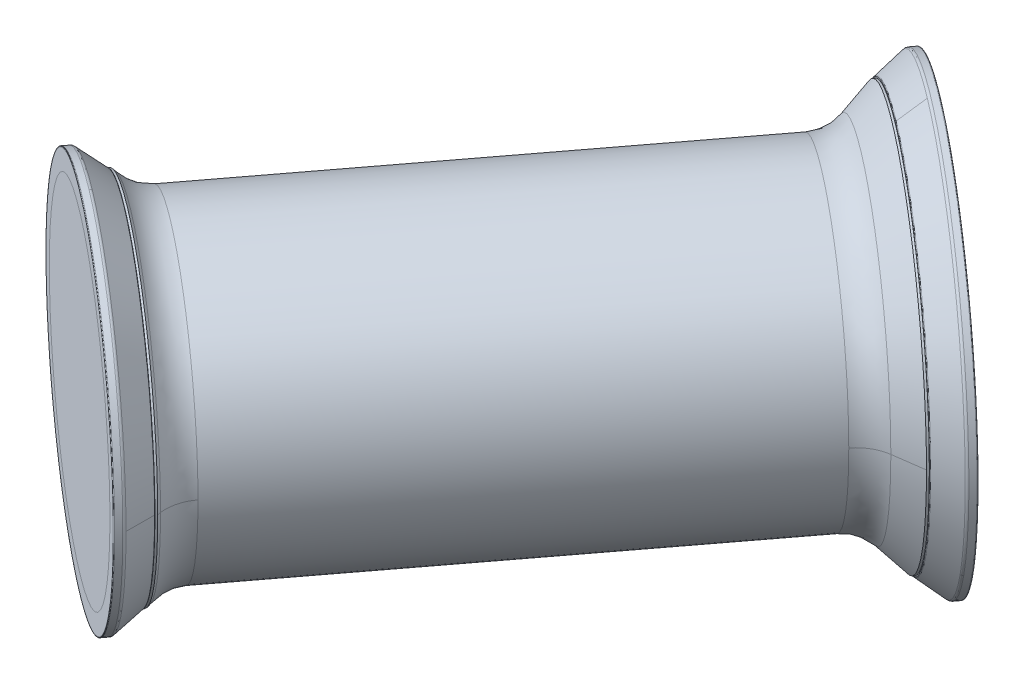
ISO-10303-21;
HEADER;
FILE_DESCRIPTION(('STEP AP214'),'2;1');
FILE_NAME('part.step','',(''),(''),'','','');
FILE_SCHEMA(('AUTOMOTIVE_DESIGN { 1 0 10303 214 1 1 1 1 }'));
ENDSEC;
DATA;
#1=APPLICATION_CONTEXT('core data for automotive mechanical design processes');
#2=APPLICATION_PROTOCOL_DEFINITION('international standard','automotive_design',2000,#1);
#3=PRODUCT_CONTEXT('',#1,'mechanical');
#4=PRODUCT('Part','Part','',(#3));
#5=PRODUCT_RELATED_PRODUCT_CATEGORY('part','',(#4));
#6=PRODUCT_DEFINITION_FORMATION('','',#4);
#7=PRODUCT_DEFINITION_CONTEXT('part definition',#1,'design');
#8=PRODUCT_DEFINITION('design','',#6,#7);
#9=PRODUCT_DEFINITION_SHAPE('','',#8);
#10=(LENGTH_UNIT() NAMED_UNIT(*) SI_UNIT(.MILLI.,.METRE.));
#11=(NAMED_UNIT(*) PLANE_ANGLE_UNIT() SI_UNIT($,.RADIAN.));
#12=(NAMED_UNIT(*) SI_UNIT($,.STERADIAN.) SOLID_ANGLE_UNIT());
#13=UNCERTAINTY_MEASURE_WITH_UNIT(LENGTH_MEASURE(1.E-05),#10,'distance_accuracy_value','');
#14=(GEOMETRIC_REPRESENTATION_CONTEXT(3) GLOBAL_UNCERTAINTY_ASSIGNED_CONTEXT((#13)) GLOBAL_UNIT_ASSIGNED_CONTEXT((#10,
#11,#12)) REPRESENTATION_CONTEXT('',''));
#15=CARTESIAN_POINT('',(0.,0.,0.));
#16=DIRECTION('',(0.,0.,1.));
#17=DIRECTION('',(1.,0.,0.));
#18=AXIS2_PLACEMENT_3D('',#15,#16,#17);
#19=CARTESIAN_POINT('',(-3.91964222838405,101.40797708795,232.149507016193));
#20=CARTESIAN_POINT('',(34.9690813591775,185.904423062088,261.603713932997));
#21=CARTESIAN_POINT('',(-32.388163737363,234.688468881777,210.587531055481));
#22=CARTESIAN_POINT('',(-71.2768873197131,150.192022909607,181.133324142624));
#23=CARTESIAN_POINT('',(-3.71447348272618,101.33737603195,232.081156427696));
#24=CARTESIAN_POINT('',(35.2868108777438,186.078391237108,261.620616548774));
#25=CARTESIAN_POINT('',(-32.2653951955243,235.003639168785,210.456770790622));
#26=CARTESIAN_POINT('',(-71.2666795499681,150.262623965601,180.917310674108));
#27=CARTESIAN_POINT('',(-3.53314516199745,101.29999999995,231.948968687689));
#28=CARTESIAN_POINT('',(35.5277286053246,186.170489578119,261.533561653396));
#29=CARTESIAN_POINT('',(-32.127689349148,235.170489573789,210.291543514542));
#30=CARTESIAN_POINT('',(-71.1885631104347,150.299999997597,180.706950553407));
#31=CARTESIAN_POINT('',(-3.39579571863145,101.29999999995,231.767624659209));
#32=CARTESIAN_POINT('',(35.6650780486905,186.170489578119,261.352217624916));
#33=CARTESIAN_POINT('',(-31.9903399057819,235.170489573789,210.110199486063));
#34=CARTESIAN_POINT('',(-71.0512136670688,150.299999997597,180.525606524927));
#35=CARTESIAN_POINT('',(-3.39567496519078,101.29999999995,231.767465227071));
#36=CARTESIAN_POINT('',(35.6651988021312,186.17048957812,261.352058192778));
#37=CARTESIAN_POINT('',(-31.9902191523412,235.170489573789,210.110040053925));
#38=CARTESIAN_POINT('',(-71.0510929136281,150.299999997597,180.525447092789));
#39=CARTESIAN_POINT('',(-3.39555421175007,101.29999999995,231.767305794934));
#40=CARTESIAN_POINT('',(35.6653195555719,186.170489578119,261.35189876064));
#41=CARTESIAN_POINT('',(-31.9900983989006,235.170489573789,210.109880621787));
#42=CARTESIAN_POINT('',(-71.0509721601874,150.299999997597,180.525287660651));
#43=CARTESIAN_POINT('',(-3.3954334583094,101.29999999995,231.767146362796));
#44=CARTESIAN_POINT('',(35.6654403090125,186.170489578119,261.351739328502));
#45=CARTESIAN_POINT('',(-31.98997764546,235.170489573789,210.109721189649));
#46=CARTESIAN_POINT('',(-71.0508514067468,150.299999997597,180.525128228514));
#47=(BOUNDED_SURFACE() B_SPLINE_SURFACE(3,3,((#19,#20,#21,#22),(#23,#24,#25,#26),(#27,#28,#29,
#30),(#31,#32,#33,#34),(#35,#36,#37,#38),(#39,#40,#41,#42),(#43,#44,#45,#46)),.UNSPECIFIED.,.F.,
.F.,.F.) B_SPLINE_SURFACE_WITH_KNOTS((4,3,4),(4,4),(0.,0.862150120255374,0.862937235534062),
(-5.27986543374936E-11,294.000000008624),
.UNSPECIFIED.) GEOMETRIC_REPRESENTATION_ITEM() RATIONAL_B_SPLINE_SURFACE(((0.98070242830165,
0.32690080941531,0.326900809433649,0.980702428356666),(0.944396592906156,0.314798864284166,
0.314798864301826,0.944396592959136),(0.944396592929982,0.314798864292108,0.314798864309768,
0.944396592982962),(0.98070242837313,0.326900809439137,0.326900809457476,0.980702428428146),
(0.98070242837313,0.326900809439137,0.326900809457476,0.980702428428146),(0.98070242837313,
0.326900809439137,0.326900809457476,0.980702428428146),(0.98070242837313,0.326900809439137,
0.326900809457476,0.980702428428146))) REPRESENTATION_ITEM('') SURFACE());
#48=CARTESIAN_POINT('',(-37.5982647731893,125.799999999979,206.641415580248));
#49=DIRECTION('',(-0.60376720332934,-3.41222512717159E-13,0.797160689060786));
#50=DIRECTION('',(0.797160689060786,0.,0.60376720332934));
#51=AXIS2_PLACEMENT_3D('',#48,#49,#50);
#52=CIRCLE('',#51,48.7840458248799);
#53=CARTESIAN_POINT('',(-3.91964222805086,101.407977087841,232.149507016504));
#54=VERTEX_POINT('',#53);
#55=CARTESIAN_POINT('',(-37.5982647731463,174.584045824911,206.641415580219));
#56=VERTEX_POINT('',#55);
#57=EDGE_CURVE('P0_E99',#54,#56,#52,.T.);
#58=CARTESIAN_POINT('',(-3.39543345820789,101.300000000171,231.767146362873));
#59=CARTESIAN_POINT('',(-3.39555421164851,101.300000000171,231.76730579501));
#60=CARTESIAN_POINT('',(-3.39567496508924,101.300000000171,231.767465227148));
#61=CARTESIAN_POINT('',(-3.39579571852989,101.300000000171,231.767624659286));
#62=CARTESIAN_POINT('',(-3.53314516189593,101.300000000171,231.948968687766));
#63=CARTESIAN_POINT('',(-3.71447348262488,101.33737603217,232.081156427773));
#64=CARTESIAN_POINT('',(-3.91964222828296,101.40797708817,232.149507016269));
#65=(BOUNDED_CURVE() B_SPLINE_CURVE(3,(#58,#59,#60,#61,#62,#63,#64),.UNSPECIFIED.,.F.,
.F.) B_SPLINE_CURVE_WITH_KNOTS((4,3,4),(0.,0.000787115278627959,0.862937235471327),
.UNSPECIFIED.) CURVE() GEOMETRIC_REPRESENTATION_ITEM() RATIONAL_B_SPLINE_CURVE((0.980702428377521,
0.980702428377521,0.980702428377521,0.98070242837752,0.944396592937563,0.94439659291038,0.980702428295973)) REPRESENTATION_ITEM(''));
#66=CARTESIAN_POINT('',(-3.39579571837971,101.300000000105,231.767624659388));
#67=VERTEX_POINT('',#66);
#68=EDGE_CURVE('P0_E81',#67,#54,#65,.T.);
#69=CARTESIAN_POINT('',(-37.2235046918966,125.799999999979,206.146615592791));
#70=DIRECTION('',(0.603767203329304,3.44747103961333E-13,-0.797160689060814));
#71=DIRECTION('',(-0.797160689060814,0.,-0.603767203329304));
#72=AXIS2_PLACEMENT_3D('',#69,#70,#71);
#73=CIRCLE('',#72,49.0000000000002);
#74=CARTESIAN_POINT('',(-71.0512136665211,150.29999999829,180.525606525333));
#75=VERTEX_POINT('',#74);
#76=EDGE_CURVE('P0_E104',#75,#67,#73,.T.);
#77=CARTESIAN_POINT('',(-71.2768873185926,150.192022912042,181.133324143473));
#78=CARTESIAN_POINT('',(-71.2666795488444,150.262623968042,180.917310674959));
#79=CARTESIAN_POINT('',(-71.1885631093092,150.300000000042,180.706950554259));
#80=CARTESIAN_POINT('',(-71.0512136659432,150.300000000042,180.525606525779));
#81=CARTESIAN_POINT('',(-71.0510929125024,150.300000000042,180.525447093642));
#82=CARTESIAN_POINT('',(-71.0509721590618,150.300000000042,180.525287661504));
#83=CARTESIAN_POINT('',(-71.0508514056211,150.300000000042,180.525128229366));
#84=(BOUNDED_CURVE() B_SPLINE_CURVE(3,(#77,#78,#79,#80,#81,#82,#83),.UNSPECIFIED.,.F.,
.F.) B_SPLINE_CURVE_WITH_KNOTS((4,3,4),(0.,0.862150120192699,0.862937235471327),
.UNSPECIFIED.) CURVE() GEOMETRIC_REPRESENTATION_ITEM() RATIONAL_B_SPLINE_CURVE((0.980702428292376,
0.944396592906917,0.9443965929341,0.980702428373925,0.980702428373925,0.980702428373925,0.980702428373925)) REPRESENTATION_ITEM(''));
#85=CARTESIAN_POINT('',(-71.2768873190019,150.192022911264,181.13332414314));
#86=VERTEX_POINT('',#85);
#87=EDGE_CURVE('P0_E95',#86,#75,#84,.T.);
#88=CARTESIAN_POINT('',(-37.5982647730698,125.799999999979,206.641415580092));
#89=DIRECTION('',(-0.60376720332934,-3.40267119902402E-13,0.797160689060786));
#90=DIRECTION('',(0.797160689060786,0.,0.60376720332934));
#91=AXIS2_PLACEMENT_3D('',#88,#89,#90);
#92=CIRCLE('',#91,48.7840458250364);
#93=EDGE_CURVE('P0_E101',#56,#86,#92,.T.);
#94=ORIENTED_EDGE('',*,*,#57,.F.);
#95=ORIENTED_EDGE('',*,*,#68,.F.);
#96=ORIENTED_EDGE('',*,*,#76,.F.);
#97=ORIENTED_EDGE('',*,*,#87,.F.);
#98=ORIENTED_EDGE('',*,*,#93,.F.);
#99=EDGE_LOOP('',(#94,#95,#96,#97,#98));
#100=FACE_BOUND('',#99,.T.);
#101=ADVANCED_FACE('P0_F16',(#100),#47,.T.);
#102=CARTESIAN_POINT('',(-71.2768873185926,150.192022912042,181.133324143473));
#103=CARTESIAN_POINT('',(-110.165610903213,65.6955769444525,151.679117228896));
#104=CARTESIAN_POINT('',(-42.8083658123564,16.9115311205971,202.695300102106));
#105=CARTESIAN_POINT('',(-3.91964222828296,101.40797708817,232.149507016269));
#106=CARTESIAN_POINT('',(-71.2666795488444,150.262623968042,180.917310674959));
#107=CARTESIAN_POINT('',(-110.267963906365,65.521608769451,151.377850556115));
#108=CARTESIAN_POINT('',(-42.7157578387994,16.5963608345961,202.541696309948));
#109=CARTESIAN_POINT('',(-3.71447348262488,101.33737603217,232.081156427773));
#110=CARTESIAN_POINT('',(-71.1885631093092,150.300000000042,180.706950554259));
#111=CARTESIAN_POINT('',(-110.249436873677,65.4295104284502,151.12235759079));
#112=CARTESIAN_POINT('',(-42.5940189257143,16.4295104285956,202.364375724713));
#113=CARTESIAN_POINT('',(-3.53314516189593,101.300000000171,231.948968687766));
#114=CARTESIAN_POINT('',(-71.0512136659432,150.300000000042,180.525606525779));
#115=CARTESIAN_POINT('',(-110.112087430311,65.4295104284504,150.94101356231));
#116=CARTESIAN_POINT('',(-42.4566694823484,16.4295104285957,202.183031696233));
#117=CARTESIAN_POINT('',(-3.39579571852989,101.300000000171,231.767624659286));
#118=CARTESIAN_POINT('',(-71.0510929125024,150.300000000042,180.525447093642));
#119=CARTESIAN_POINT('',(-110.11196667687,65.4295104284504,150.940854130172));
#120=CARTESIAN_POINT('',(-42.4565487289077,16.4295104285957,202.182872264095));
#121=CARTESIAN_POINT('',(-3.39567496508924,101.300000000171,231.767465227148));
#122=CARTESIAN_POINT('',(-71.0509721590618,150.300000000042,180.525287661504));
#123=CARTESIAN_POINT('',(-110.11184592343,65.4295104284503,150.940694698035));
#124=CARTESIAN_POINT('',(-42.4564279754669,16.4295104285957,202.182712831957));
#125=CARTESIAN_POINT('',(-3.39555421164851,101.300000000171,231.76730579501));
#126=CARTESIAN_POINT('',(-71.0508514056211,150.300000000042,180.525128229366));
#127=CARTESIAN_POINT('',(-110.111725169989,65.4295104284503,150.940535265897));
#128=CARTESIAN_POINT('',(-42.4563072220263,16.4295104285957,202.18255339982));
#129=CARTESIAN_POINT('',(-3.39543345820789,101.300000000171,231.767146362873));
#130=(BOUNDED_SURFACE() B_SPLINE_SURFACE(3,3,((#102,#103,#104,#105),(#106,#107,#108,#109),(#110,
#111,#112,#113),(#114,#115,#116,#117),(#118,#119,#120,#121),(#122,#123,#124,#125),(#126,#127,
#128,#129)),.UNSPECIFIED.,.F.,.F.,.F.) B_SPLINE_SURFACE_WITH_KNOTS((4,3,4),(4,4),(0.,
0.862150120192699,0.862937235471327),(-1.71706204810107E-10,294.000000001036),
.UNSPECIFIED.) GEOMETRIC_REPRESENTATION_ITEM() RATIONAL_B_SPLINE_SURFACE(((0.980702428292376,
0.32690080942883,0.326900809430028,0.980702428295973),(0.944396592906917,0.314798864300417,
0.314798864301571,0.94439659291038),(0.9443965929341,0.314798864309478,0.314798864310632,
0.944396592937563),(0.980702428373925,0.326900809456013,0.326900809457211,0.98070242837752),
(0.980702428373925,0.326900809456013,0.326900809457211,0.980702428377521),(0.980702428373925,
0.326900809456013,0.326900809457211,0.980702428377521),(0.980702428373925,0.326900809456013,
0.326900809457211,0.980702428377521))) REPRESENTATION_ITEM('') SURFACE());
#131=CARTESIAN_POINT('',(-37.5982647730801,125.799999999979,206.641415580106));
#132=DIRECTION('',(-0.60376720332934,-3.41179572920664E-13,0.797160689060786));
#133=DIRECTION('',(0.797160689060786,0.,0.60376720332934));
#134=AXIS2_PLACEMENT_3D('',#131,#132,#133);
#135=CIRCLE('',#134,48.7840458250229);
#136=CARTESIAN_POINT('',(-37.5982647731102,77.0159541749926,206.641415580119));
#137=VERTEX_POINT('',#136);
#138=EDGE_CURVE('P0_E119',#86,#137,#135,.T.);
#139=CARTESIAN_POINT('',(-37.2235046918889,125.799999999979,206.146615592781));
#140=DIRECTION('',(0.603767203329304,3.45027648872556E-13,-0.797160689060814));
#141=DIRECTION('',(-0.797160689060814,0.,-0.603767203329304));
#142=AXIS2_PLACEMENT_3D('',#139,#140,#141);
#143=CIRCLE('',#142,49.0000000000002);
#144=EDGE_CURVE('P0_E90',#67,#75,#143,.T.);
#145=CARTESIAN_POINT('',(-37.5982647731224,125.799999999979,206.64141558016));
#146=DIRECTION('',(-0.603767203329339,-3.41676055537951E-13,0.797160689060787));
#147=DIRECTION('',(0.797160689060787,0.,0.60376720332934));
#148=AXIS2_PLACEMENT_3D('',#145,#146,#147);
#149=CIRCLE('',#148,48.7840458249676);
#150=EDGE_CURVE('P0_E87',#137,#54,#149,.T.);
#151=ORIENTED_EDGE('',*,*,#138,.F.);
#152=ORIENTED_EDGE('',*,*,#87,.T.);
#153=ORIENTED_EDGE('',*,*,#144,.F.);
#154=ORIENTED_EDGE('',*,*,#68,.T.);
#155=ORIENTED_EDGE('',*,*,#150,.F.);
#156=EDGE_LOOP('',(#151,#152,#153,#154,#155));
#157=FACE_BOUND('',#156,.T.);
#158=ADVANCED_FACE('P0_F85',(#157),#130,.T.);
#159=CARTESIAN_POINT('',(-74.803578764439,125.799999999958,255.764013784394));
#160=CARTESIAN_POINT('',(8.90134439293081,125.799999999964,234.128400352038));
#161=CARTESIAN_POINT('',(-74.803578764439,125.799999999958,255.764013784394));
#162=CARTESIAN_POINT('',(8.90134439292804,72.1365995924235,234.128400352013));
#163=CARTESIAN_POINT('',(-74.803578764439,125.799999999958,255.764013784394));
#164=CARTESIAN_POINT('',(-33.8770088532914,72.1365995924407,201.72819916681));
#165=CARTESIAN_POINT('',(-74.803578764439,125.799999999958,255.764013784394));
#166=CARTESIAN_POINT('',(-76.6553620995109,72.136599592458,169.327997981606));
#167=CARTESIAN_POINT('',(-74.803578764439,125.799999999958,255.764013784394));
#168=CARTESIAN_POINT('',(-76.6553620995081,125.799999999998,169.327997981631));
#169=CARTESIAN_POINT('',(-74.803578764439,125.799999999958,255.764013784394));
#170=CARTESIAN_POINT('',(-76.6553620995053,179.463400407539,169.327997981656));
#171=CARTESIAN_POINT('',(-74.803578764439,125.799999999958,255.764013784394));
#172=CARTESIAN_POINT('',(-33.8770088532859,179.463400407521,201.728199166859));
#173=CARTESIAN_POINT('',(-74.803578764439,125.799999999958,255.764013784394));
#174=CARTESIAN_POINT('',(8.90134439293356,179.463400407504,234.128400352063));
#175=CARTESIAN_POINT('',(-74.803578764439,125.799999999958,255.764013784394));
#176=CARTESIAN_POINT('',(8.90134439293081,125.799999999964,234.128400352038));
#177=(BOUNDED_SURFACE() B_SPLINE_SURFACE(2,1,((#159,#160),(#161,#162),(#163,#164),(#165,#166),
(#167,#168),(#169,#170),(#171,#172),(#173,#174),(#175,#176)),.UNSPECIFIED.,.T.,.F.,
.F.) B_SPLINE_SURFACE_WITH_KNOTS((3,2,2,2,3),(2,2),(0.,84.2942722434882,168.588544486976,
252.882816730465,337.177088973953),(0.,86.455849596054),
.UNSPECIFIED.) GEOMETRIC_REPRESENTATION_ITEM() RATIONAL_B_SPLINE_SURFACE(((1.,1.),
(0.707106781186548,0.707106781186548),(1.,1.),(0.707106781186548,0.707106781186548),(1.,1.),
(0.707106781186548,0.707106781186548),(1.,1.),(0.707106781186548,0.707106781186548),(1.,1.))) REPRESENTATION_ITEM('') SURFACE());
#178=DIRECTION('',(0.473381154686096,-0.620702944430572,-0.625010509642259));
#179=VECTOR('',#178,1.);
#180=CARTESIAN_POINT('',(-54.3402938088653,98.9682997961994,228.746106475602));
#181=LINE('',#180,#179);
#182=CARTESIAN_POINT('',(-40.9416662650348,81.399861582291,211.055746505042));
#183=VERTEX_POINT('',#182);
#184=EDGE_CURVE('P0_E108',#183,#137,#181,.T.);
#185=CARTESIAN_POINT('',(-40.9416662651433,125.800000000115,211.055746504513));
#186=DIRECTION('',(-0.603767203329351,-3.44338298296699E-13,0.797160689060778));
#187=DIRECTION('',(0.797160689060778,0.,0.603767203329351));
#188=AXIS2_PLACEMENT_3D('',#185,#186,#187);
#189=CIRCLE('',#188,44.4001384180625);
#190=CARTESIAN_POINT('',(-71.5938083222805,148.000069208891,187.839902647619));
#191=VERTEX_POINT('',#190);
#192=EDGE_CURVE('P0_E308',#191,#183,#189,.T.);
#193=CARTESIAN_POINT('',(-10.2895242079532,103.599930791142,234.271590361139));
#194=CARTESIAN_POINT('',(25.1045207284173,180.503226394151,261.078937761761));
#195=CARTESIAN_POINT('',(-36.1997633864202,224.903364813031,214.647250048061));
#196=CARTESIAN_POINT('',(-71.5938083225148,148.000069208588,187.839902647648));
#197=(BOUNDED_CURVE() B_SPLINE_CURVE(3,(#193,#194,#195,#196),.UNSPECIFIED.,.F.,
.F.) B_SPLINE_CURVE_WITH_KNOTS((4,4),(-2.35161223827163E-10,266.400830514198),
.UNSPECIFIED.) CURVE() GEOMETRIC_REPRESENTATION_ITEM() RATIONAL_B_SPLINE_CURVE((0.974753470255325,
0.324917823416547,0.3249178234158,0.974753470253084)) REPRESENTATION_ITEM(''));
#198=CARTESIAN_POINT('',(-40.9416662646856,170.200138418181,211.055746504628));
#199=VERTEX_POINT('',#198);
#200=EDGE_CURVE('P0_E350',#199,#191,#197,.T.);
#201=DIRECTION('',(-0.473381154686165,-0.620702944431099,0.625010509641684));
#202=VECTOR('',#201,1.);
#203=CARTESIAN_POINT('',(-54.3402938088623,152.63170020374,228.746106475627));
#204=LINE('',#203,#202);
#205=EDGE_CURVE('P0_E110',#56,#199,#204,.T.);
#206=ORIENTED_EDGE('',*,*,#184,.F.);
#207=ORIENTED_EDGE('',*,*,#192,.F.);
#208=ORIENTED_EDGE('',*,*,#200,.F.);
#209=ORIENTED_EDGE('',*,*,#205,.F.);
#210=ORIENTED_EDGE('',*,*,#93,.T.);
#211=ORIENTED_EDGE('',*,*,#138,.T.);
#212=EDGE_LOOP('',(#206,#207,#208,#209,#210,#211));
#213=FACE_BOUND('',#212,.T.);
#214=ADVANCED_FACE('P0_F140',(#213),#177,.T.);
#215=CARTESIAN_POINT('',(-74.803578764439,125.799999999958,255.764013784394));
#216=CARTESIAN_POINT('',(-76.6553620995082,125.799999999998,169.327997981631));
#217=CARTESIAN_POINT('',(-74.803578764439,125.799999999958,255.764013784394));
#218=CARTESIAN_POINT('',(-76.6553620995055,179.463400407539,169.327997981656));
#219=CARTESIAN_POINT('',(-74.803578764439,125.799999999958,255.764013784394));
#220=CARTESIAN_POINT('',(-33.877008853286,179.463400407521,201.728199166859));
#221=CARTESIAN_POINT('',(-74.803578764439,125.799999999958,255.764013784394));
#222=CARTESIAN_POINT('',(8.90134439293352,179.463400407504,234.128400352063));
#223=CARTESIAN_POINT('',(-74.803578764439,125.799999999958,255.764013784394));
#224=CARTESIAN_POINT('',(8.90134439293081,125.799999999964,234.128400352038));
#225=CARTESIAN_POINT('',(-74.803578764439,125.799999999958,255.764013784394));
#226=CARTESIAN_POINT('',(8.90134439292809,72.1365995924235,234.128400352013));
#227=CARTESIAN_POINT('',(-74.803578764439,125.799999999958,255.764013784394));
#228=CARTESIAN_POINT('',(-33.8770088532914,72.1365995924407,201.72819916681));
#229=CARTESIAN_POINT('',(-74.803578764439,125.799999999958,255.764013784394));
#230=CARTESIAN_POINT('',(-76.655362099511,72.1365995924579,169.327997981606));
#231=CARTESIAN_POINT('',(-74.803578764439,125.799999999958,255.764013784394));
#232=CARTESIAN_POINT('',(-76.6553620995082,125.799999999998,169.327997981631));
#233=(BOUNDED_SURFACE() B_SPLINE_SURFACE(2,1,((#215,#216),(#217,#218),(#219,#220),(#221,#222),
(#223,#224),(#225,#226),(#227,#228),(#229,#230),(#231,#232)),.UNSPECIFIED.,.T.,.F.,
.F.) B_SPLINE_SURFACE_WITH_KNOTS((3,2,2,2,3),(2,2),(0.,84.2942722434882,168.588544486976,
252.882816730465,337.177088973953),(0.,86.455849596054),
.UNSPECIFIED.) GEOMETRIC_REPRESENTATION_ITEM() RATIONAL_B_SPLINE_SURFACE(((1.,1.),
(0.707106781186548,0.707106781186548),(1.,1.),(0.707106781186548,0.707106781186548),(1.,1.),
(0.707106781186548,0.707106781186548),(1.,1.),(0.707106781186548,0.707106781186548),(1.,1.))) REPRESENTATION_ITEM('') SURFACE());
#234=CARTESIAN_POINT('',(-10.2895242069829,103.599930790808,234.271590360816));
#235=CARTESIAN_POINT('',(25.10452072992,180.503226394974,261.078937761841));
#236=CARTESIAN_POINT('',(-36.1997633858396,224.903364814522,214.647250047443));
#237=CARTESIAN_POINT('',(-71.5938083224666,148.000069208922,187.839902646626));
#238=(BOUNDED_CURVE() B_SPLINE_CURVE(3,(#234,#235,#236,#237),.UNSPECIFIED.,.F.,
.F.) B_SPLINE_CURVE_WITH_KNOTS((4,4),(-2.35161223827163E-10,266.400830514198),
.UNSPECIFIED.) CURVE() GEOMETRIC_REPRESENTATION_ITEM() RATIONAL_B_SPLINE_CURVE((0.974753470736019,
0.324917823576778,0.324917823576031,0.974753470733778)) REPRESENTATION_ITEM(''));
#239=CARTESIAN_POINT('',(-10.2895242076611,103.599930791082,234.271590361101));
#240=VERTEX_POINT('',#239);
#241=EDGE_CURVE('P0_E371',#240,#199,#238,.T.);
#242=CARTESIAN_POINT('',(-40.9416662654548,125.800000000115,211.055746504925));
#243=DIRECTION('',(-0.603767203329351,-3.44585786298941E-13,0.797160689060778));
#244=DIRECTION('',(0.797160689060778,0.,0.603767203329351));
#245=AXIS2_PLACEMENT_3D('',#242,#243,#244);
#246=CIRCLE('',#245,44.400138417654);
#247=EDGE_CURVE('P0_E299',#183,#240,#246,.T.);
#248=ORIENTED_EDGE('',*,*,#150,.T.);
#249=ORIENTED_EDGE('',*,*,#57,.T.);
#250=ORIENTED_EDGE('',*,*,#205,.T.);
#251=ORIENTED_EDGE('',*,*,#241,.F.);
#252=ORIENTED_EDGE('',*,*,#247,.F.);
#253=ORIENTED_EDGE('',*,*,#184,.T.);
#254=EDGE_LOOP('',(#248,#249,#250,#251,#252,#253));
#255=FACE_BOUND('',#254,.T.);
#256=ADVANCED_FACE('P0_F106',(#255),#233,.T.);
#257=CARTESIAN_POINT('',(-36.2583892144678,125.799999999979,204.872362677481));
#258=DIRECTION('',(-0.603767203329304,-3.44295560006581E-13,0.797160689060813));
#259=DIRECTION('',(0.797160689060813,0.,0.603767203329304));
#260=AXIS2_PLACEMENT_3D('',#257,#258,#259);
#261=CYLINDRICAL_SURFACE('',#260,48.9999999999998);
#262=CARTESIAN_POINT('',(-36.3467856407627,125.799999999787,204.989073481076));
#263=DIRECTION('',(0.603767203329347,3.35917532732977E-13,-0.797160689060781));
#264=DIRECTION('',(-0.797160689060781,0.,-0.603767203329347));
#265=AXIS2_PLACEMENT_3D('',#262,#263,#264);
#266=CIRCLE('',#265,49.0000000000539);
#267=CARTESIAN_POINT('',(-70.1744946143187,150.30000000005,179.368064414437));
#268=VERTEX_POINT('',#267);
#269=CARTESIAN_POINT('',(-2.51907666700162,101.29999999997,230.61008254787));
#270=VERTEX_POINT('',#269);
#271=EDGE_CURVE('P0_E230',#268,#270,#266,.T.);
#272=ORIENTED_EDGE('',*,*,#271,.F.);
#273=CARTESIAN_POINT('',(-36.3467856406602,125.80000000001,204.989073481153));
#274=DIRECTION('',(0.603767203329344,3.44768162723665E-13,-0.797160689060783));
#275=DIRECTION('',(-0.797160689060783,0.,-0.603767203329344));
#276=AXIS2_PLACEMENT_3D('',#273,#274,#275);
#277=CIRCLE('',#276,49.0000000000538);
#278=EDGE_CURVE('P0_E239',#270,#268,#277,.T.);
#279=ORIENTED_EDGE('',*,*,#278,.F.);
#280=EDGE_LOOP('',(#272,#279));
#281=FACE_BOUND('',#280,.T.);
#282=ORIENTED_EDGE('',*,*,#76,.T.);
#283=ORIENTED_EDGE('',*,*,#144,.T.);
#284=EDGE_LOOP('',(#282,#283));
#285=FACE_BOUND('',#284,.T.);
#286=ADVANCED_FACE('P0_F394',(#281,#285),#261,.T.);
#287=CARTESIAN_POINT('',(-71.5938083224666,148.000069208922,187.839902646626));
#288=CARTESIAN_POINT('',(-36.1997633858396,224.903364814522,214.647250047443));
#289=CARTESIAN_POINT('',(25.10452072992,180.503226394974,261.078937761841));
#290=CARTESIAN_POINT('',(-10.2895242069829,103.599930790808,234.271590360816));
#291=CARTESIAN_POINT('',(-71.6007863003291,147.951806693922,187.987568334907));
#292=CARTESIAN_POINT('',(-36.2836873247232,224.687916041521,214.736637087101));
#293=CARTESIAN_POINT('',(24.8873224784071,180.384302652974,261.067383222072));
#294=CARTESIAN_POINT('',(-10.4297764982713,103.648193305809,234.318314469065));
#295=CARTESIAN_POINT('',(-71.5450319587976,147.881812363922,188.114750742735));
#296=CARTESIAN_POINT('',(-36.3395264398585,224.375454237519,214.779298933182));
#297=CARTESIAN_POINT('',(24.6381978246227,180.211829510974,260.963651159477));
#298=CARTESIAN_POINT('',(-10.5673076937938,103.718187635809,234.299102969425));
#299=CARTESIAN_POINT('',(-71.4376743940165,147.804057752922,188.196063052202));
#300=CARTESIAN_POINT('',(-36.3561347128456,224.028349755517,214.766719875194));
#301=CARTESIAN_POINT('',(24.4068744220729,180.020234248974,260.788447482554));
#302=CARTESIAN_POINT('',(-10.6746652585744,103.79594224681,234.217790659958));
#303=CARTESIAN_POINT('',(-71.4375363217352,147.803957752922,188.196167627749));
#304=CARTESIAN_POINT('',(-36.3561560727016,224.027903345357,214.766703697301));
#305=CARTESIAN_POINT('',(24.4065769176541,180.019987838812,260.788222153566));
#306=CARTESIAN_POINT('',(-10.6748033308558,103.79604224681,234.217686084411));
#307=CARTESIAN_POINT('',(-71.4373982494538,147.803857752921,188.196272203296));
#308=CARTESIAN_POINT('',(-36.3561774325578,224.027456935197,214.766687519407));
#309=CARTESIAN_POINT('',(24.4062794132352,180.01974142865,260.787996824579));
#310=CARTESIAN_POINT('',(-10.6749414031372,103.796142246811,234.217581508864));
#311=CARTESIAN_POINT('',(-71.4372601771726,147.803757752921,188.196376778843));
#312=CARTESIAN_POINT('',(-36.356198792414,224.027010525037,214.766671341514));
#313=CARTESIAN_POINT('',(24.4059819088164,180.019495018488,260.787771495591));
#314=CARTESIAN_POINT('',(-10.6750794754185,103.796242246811,234.217476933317));
#315=(BOUNDED_SURFACE() B_SPLINE_SURFACE(3,3,((#287,#288,#289,#290),(#291,#292,#293,#294),(#295,
#296,#297,#298),(#299,#300,#301,#302),(#303,#304,#305,#306),(#307,#308,#309,#310),(#311,#312,
#313,#314)),.UNSPECIFIED.,.F.,.F.,.F.) B_SPLINE_SURFACE_WITH_KNOTS((4,3,4),(4,4),(0.,
0.915969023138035,0.917231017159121),(-2.35155894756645E-10,266.400830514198),
.UNSPECIFIED.) GEOMETRIC_REPRESENTATION_ITEM() RATIONAL_B_SPLINE_SURFACE(((0.974753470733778,
0.324917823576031,0.324917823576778,0.974753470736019),(0.90989678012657,0.303298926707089,
0.303298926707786,0.909896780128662),(0.909896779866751,0.303298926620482,0.303298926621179,
0.909896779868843),(0.974753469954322,0.324917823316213,0.32491782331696,0.974753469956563),
(0.974753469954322,0.324917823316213,0.32491782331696,0.974753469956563),(0.974753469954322,
0.324917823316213,0.32491782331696,0.974753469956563),(0.974753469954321,0.324917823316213,
0.32491782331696,0.974753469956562))) REPRESENTATION_ITEM('') SURFACE());
#316=CARTESIAN_POINT('',(-71.4376743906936,147.804057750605,188.196063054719));
#317=CARTESIAN_POINT('',(-71.4439756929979,147.808621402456,188.191290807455));
#318=CARTESIAN_POINT('',(-71.4501257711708,147.813185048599,188.18631891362));
#319=CARTESIAN_POINT('',(-71.4621722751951,147.822349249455,188.175934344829));
#320=CARTESIAN_POINT('',(-71.4680651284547,147.826949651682,188.170517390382));
#321=CARTESIAN_POINT('',(-71.4795602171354,147.836166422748,188.159253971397));
#322=CARTESIAN_POINT('',(-71.4851591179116,147.840782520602,188.153403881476));
#323=CARTESIAN_POINT('',(-71.4960309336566,147.850008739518,188.141290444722));
#324=CARTESIAN_POINT('',(-71.5013008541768,147.854618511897,188.135024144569));
#325=CARTESIAN_POINT('',(-71.5114812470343,147.863809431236,188.122099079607));
#326=CARTESIAN_POINT('',(-71.5163891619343,147.868390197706,188.115438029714));
#327=CARTESIAN_POINT('',(-71.5258146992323,147.877500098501,188.101748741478));
#328=CARTESIAN_POINT('',(-71.5303302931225,147.882028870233,188.094718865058));
#329=CARTESIAN_POINT('',(-71.5389435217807,147.891011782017,188.080321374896));
#330=CARTESIAN_POINT('',(-71.5430397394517,147.895465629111,188.072952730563));
#331=CARTESIAN_POINT('',(-71.5507902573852,147.904276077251,188.057910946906));
#332=CARTESIAN_POINT('',(-71.5544438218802,147.908632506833,188.050237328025));
#333=CARTESIAN_POINT('',(-71.5612892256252,147.917226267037,188.034622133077));
#334=CARTESIAN_POINT('',(-71.5644810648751,147.921463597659,188.026680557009));
#335=CARTESIAN_POINT('',(-71.5703877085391,147.929798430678,188.010568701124));
#336=CARTESIAN_POINT('',(-71.5731032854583,147.93389615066,188.002398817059));
#337=CARTESIAN_POINT('',(-71.5780468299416,147.941932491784,187.985871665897));
#338=CARTESIAN_POINT('',(-71.5802763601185,147.945871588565,187.977515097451));
#339=CARTESIAN_POINT('',(-71.5842420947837,147.953573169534,187.960657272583));
#340=CARTESIAN_POINT('',(-71.5859806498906,147.957336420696,187.952156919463));
#341=CARTESIAN_POINT('',(-71.588963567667,147.964670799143,187.935054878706));
#342=CARTESIAN_POINT('',(-71.5902110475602,147.968243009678,187.926454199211));
#343=CARTESIAN_POINT('',(-71.5922157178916,147.975182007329,187.90919481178));
#344=CARTESIAN_POINT('',(-71.592976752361,147.978550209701,187.90053711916));
#345=CARTESIAN_POINT('',(-71.5940168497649,147.985070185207,187.883206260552));
#346=CARTESIAN_POINT('',(-71.5943004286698,147.98822371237,187.874534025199));
#347=CARTESIAN_POINT('',(-71.5943985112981,147.994305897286,187.85721532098));
#348=CARTESIAN_POINT('',(-71.5942181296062,147.997236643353,187.848569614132));
#349=CARTESIAN_POINT('',(-71.5938083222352,148.000069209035,187.839902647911));
#350=B_SPLINE_CURVE_WITH_KNOTS('',3,(#316,#317,#318,#319,#320,#321,#322,#323,#324,#325,#326,
#327,#328,#329,#330,#331,#332,#333,#334,#335,#336,#337,#338,#339,#340,#341,#342,#343,#344,#345,
#346,#347,#348,#349),.UNSPECIFIED.,.F.,.F.,(4,2,2,2,2,2,2,2,2,2,2,2,2,2,2,2,4),(0.,
0.0273784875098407,0.0550608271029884,0.0830090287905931,0.111182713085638,0.139539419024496,
0.168034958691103,0.196623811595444,0.225259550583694,0.253895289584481,0.282484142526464,
0.310979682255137,0.339336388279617,0.367510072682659,0.395458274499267,0.423140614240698,
0.450519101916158),.UNSPECIFIED.);
#351=CARTESIAN_POINT('',(-71.4376743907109,147.804057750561,188.196063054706));
#352=VERTEX_POINT('',#351);
#353=EDGE_CURVE('P0_E327',#352,#191,#350,.T.);
#354=CARTESIAN_POINT('',(-71.4376743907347,147.804057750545,188.196063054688));
#355=CARTESIAN_POINT('',(-36.3561347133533,224.028349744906,214.766719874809));
#356=CARTESIAN_POINT('',(24.4068744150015,180.020234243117,260.788447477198));
#357=CARTESIAN_POINT('',(-10.6746652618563,103.795942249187,234.217790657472));
#358=(BOUNDED_CURVE() B_SPLINE_CURVE(3,(#354,#355,#356,#357),.UNSPECIFIED.,.F.,
.F.) B_SPLINE_CURVE_WITH_KNOTS((4,4),(-2.35155894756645E-10,266.400830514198),
.UNSPECIFIED.) CURVE() GEOMETRIC_REPRESENTATION_ITEM() RATIONAL_B_SPLINE_CURVE((0.974753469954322,
0.324917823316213,0.32491782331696,0.974753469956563)) REPRESENTATION_ITEM(''));
#359=CARTESIAN_POINT('',(-10.6746652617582,103.795942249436,234.217790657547));
#360=VERTEX_POINT('',#359);
#361=EDGE_CURVE('P0_E411',#360,#352,#358,.F.);
#362=CARTESIAN_POINT('',(-10.2895242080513,103.599930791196,234.271590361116));
#363=CARTESIAN_POINT('',(-10.2977559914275,103.602763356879,234.274332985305));
#364=CARTESIAN_POINT('',(-10.3060294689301,103.605694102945,234.276849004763));
#365=CARTESIAN_POINT('',(-10.322727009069,103.611776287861,234.281446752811));
#366=CARTESIAN_POINT('',(-10.3311517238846,103.614929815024,234.283523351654));
#367=CARTESIAN_POINT('',(-10.3481161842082,103.62144979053,234.287217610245));
#368=CARTESIAN_POINT('',(-10.3566562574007,103.624817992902,234.288830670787));
#369=CARTESIAN_POINT('',(-10.3738132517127,103.631756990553,234.291577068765));
#370=CARTESIAN_POINT('',(-10.3824302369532,103.635329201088,234.29270643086));
#371=CARTESIAN_POINT('',(-10.3997008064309,103.642663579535,234.294468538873));
#372=CARTESIAN_POINT('',(-10.408354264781,103.646426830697,234.295098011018));
#373=CARTESIAN_POINT('',(-10.4256560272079,103.654128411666,234.295847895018));
#374=CARTESIAN_POINT('',(-10.4343040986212,103.658067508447,234.295965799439));
#375=CARTESIAN_POINT('',(-10.4515524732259,103.666103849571,234.295684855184));
#376=CARTESIAN_POINT('',(-10.4601525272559,103.670201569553,234.295284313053));
#377=CARTESIAN_POINT('',(-10.4772620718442,103.678536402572,234.293963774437));
#378=CARTESIAN_POINT('',(-10.4857713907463,103.682773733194,234.293042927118));
#379=CARTESIAN_POINT('',(-10.5026571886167,103.691367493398,234.29068417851));
#380=CARTESIAN_POINT('',(-10.5110336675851,103.69572392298,234.289246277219));
#381=CARTESIAN_POINT('',(-10.5276127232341,103.70453437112,234.28586091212));
#382=CARTESIAN_POINT('',(-10.5358155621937,103.708988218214,234.283914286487));
#383=CARTESIAN_POINT('',(-10.5520081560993,103.717971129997,234.279523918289));
#384=CARTESIAN_POINT('',(-10.5599985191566,103.722499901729,234.27708181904));
#385=CARTESIAN_POINT('',(-10.5757294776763,103.731609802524,234.271717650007));
#386=CARTESIAN_POINT('',(-10.5834711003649,103.736190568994,234.268797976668));
#387=CARTESIAN_POINT('',(-10.5986709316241,103.745381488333,234.262500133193));
#388=CARTESIAN_POINT('',(-10.6061306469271,103.749991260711,234.259125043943));
#389=CARTESIAN_POINT('',(-10.6207365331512,103.759217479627,234.251941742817));
#390=CARTESIAN_POINT('',(-10.6278847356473,103.763833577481,234.248137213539));
#391=CARTESIAN_POINT('',(-10.6418412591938,103.773050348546,234.240123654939));
#392=CARTESIAN_POINT('',(-10.6486521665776,103.777650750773,234.235918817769));
#393=CARTESIAN_POINT('',(-10.6619121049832,103.786814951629,234.22713636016));
#394=CARTESIAN_POINT('',(-10.6683642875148,103.791378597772,234.222563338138));
#395=CARTESIAN_POINT('',(-10.6746652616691,103.795942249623,234.217790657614));
#396=B_SPLINE_CURVE_WITH_KNOTS('',3,(#362,#363,#364,#365,#366,#367,#368,#369,#370,#371,#372,
#373,#374,#375,#376,#377,#378,#379,#380,#381,#382,#383,#384,#385,#386,#387,#388,#389,#390,#391,
#392,#393,#394,#395),.UNSPECIFIED.,.F.,.F.,(4,2,2,2,2,2,2,2,2,2,2,2,2,2,2,2,4),(0.,
0.0273784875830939,0.0550608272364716,0.0830090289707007,0.111182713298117,0.139539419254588,
0.168034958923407,0.19662381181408,0.225259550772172,0.253895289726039,0.282484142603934,
0.310979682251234,0.339336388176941,0.36751007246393,0.395458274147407,0.423140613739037,
0.450519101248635),.UNSPECIFIED.);
#397=EDGE_CURVE('P0_E307',#240,#360,#396,.T.);
#398=ORIENTED_EDGE('',*,*,#200,.T.);
#399=ORIENTED_EDGE('',*,*,#353,.F.);
#400=ORIENTED_EDGE('',*,*,#361,.F.);
#401=ORIENTED_EDGE('',*,*,#397,.F.);
#402=ORIENTED_EDGE('',*,*,#241,.T.);
#403=EDGE_LOOP('',(#398,#399,#400,#401,#402));
#404=FACE_BOUND('',#403,.T.);
#405=ADVANCED_FACE('P0_F276',(#404),#315,.T.);
#406=CARTESIAN_POINT('',(-10.2895242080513,103.599930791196,234.271590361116));
#407=CARTESIAN_POINT('',(-45.6835691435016,26.696635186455,207.46424296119));
#408=CARTESIAN_POINT('',(-106.987853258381,71.0967736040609,161.032555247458));
#409=CARTESIAN_POINT('',(-71.5938083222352,148.000069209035,187.839902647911));
#410=CARTESIAN_POINT('',(-10.4297764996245,103.648193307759,234.318314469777));
#411=CARTESIAN_POINT('',(-45.7468754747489,26.9120839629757,207.569245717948));
#412=CARTESIAN_POINT('',(-106.917885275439,71.2156973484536,161.238499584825));
#413=CARTESIAN_POINT('',(-71.6007863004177,147.951806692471,187.987568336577));
#414=CARTESIAN_POINT('',(-10.5673076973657,103.718187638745,234.29910296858));
#415=CARTESIAN_POINT('',(-45.7728132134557,27.2245457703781,207.63455478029));
#416=CARTESIAN_POINT('',(-106.750537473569,71.3881704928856,161.450202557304));
#417=CARTESIAN_POINT('',(-71.5450319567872,147.881812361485,188.114750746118));
#418=CARTESIAN_POINT('',(-10.6746652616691,103.795942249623,234.217790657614));
#419=CARTESIAN_POINT('',(-45.7562049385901,27.5716502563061,207.647133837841));
#420=CARTESIAN_POINT('',(-106.519214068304,71.5797657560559,161.625406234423));
#421=CARTESIAN_POINT('',(-71.4376743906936,147.804057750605,188.196063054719));
#422=CARTESIAN_POINT('',(-10.6748033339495,103.796042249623,234.217686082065));
#423=CARTESIAN_POINT('',(-45.7561835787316,27.5720966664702,207.647150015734));
#424=CARTESIAN_POINT('',(-106.518916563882,71.5800121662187,161.62563156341));
#425=CARTESIAN_POINT('',(-71.4375363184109,147.803957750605,188.196167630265));
#426=CARTESIAN_POINT('',(-10.6749414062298,103.796142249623,234.217581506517));
#427=CARTESIAN_POINT('',(-45.7561622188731,27.5725430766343,207.647166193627));
#428=CARTESIAN_POINT('',(-106.518619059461,71.5802585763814,161.625856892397));
#429=CARTESIAN_POINT('',(-71.4373982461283,147.803857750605,188.19627220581));
#430=CARTESIAN_POINT('',(-10.6750794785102,103.796242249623,234.217476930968));
#431=CARTESIAN_POINT('',(-45.7561408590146,27.5729894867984,207.647182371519));
#432=CARTESIAN_POINT('',(-106.518321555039,71.5805049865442,161.626082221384));
#433=CARTESIAN_POINT('',(-71.4372601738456,147.803757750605,188.196376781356));
#434=(BOUNDED_SURFACE() B_SPLINE_SURFACE(3,3,((#406,#407,#408,#409),(#410,#411,#412,#413),(#414,
#415,#416,#417),(#418,#419,#420,#421),(#422,#423,#424,#425),(#426,#427,#428,#429),(#430,#431,
#432,#433)),.UNSPECIFIED.,.F.,.F.,.F.) B_SPLINE_SURFACE_WITH_KNOTS((4,3,4),(4,4),
(-3.10554339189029E-10,0.915889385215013,0.917151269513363),(-9.58376489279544E-10,
266.400830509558),
.UNSPECIFIED.) GEOMETRIC_REPRESENTATION_ITEM() RATIONAL_B_SPLINE_SURFACE(((0.974753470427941,
0.324917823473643,0.324917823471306,0.974753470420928),(0.909896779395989,0.303298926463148,
0.303298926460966,0.909896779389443),(0.909896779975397,0.303298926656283,0.3032989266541,
0.90989677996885),(0.974753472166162,0.32491782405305,0.324917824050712,0.974753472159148),
(0.974753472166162,0.32491782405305,0.324917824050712,0.974753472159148),(0.974753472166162,
0.32491782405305,0.324917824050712,0.974753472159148),(0.974753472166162,0.32491782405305,
0.324917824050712,0.974753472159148))) REPRESENTATION_ITEM('') SURFACE());
#435=CARTESIAN_POINT('',(-10.6746652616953,103.795942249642,234.217790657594));
#436=CARTESIAN_POINT('',(-45.7562049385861,27.5716502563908,207.647133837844));
#437=CARTESIAN_POINT('',(-106.519214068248,71.5797657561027,161.625406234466));
#438=CARTESIAN_POINT('',(-71.4376743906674,147.804057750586,188.196063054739));
#439=(BOUNDED_CURVE() B_SPLINE_CURVE(3,(#435,#436,#437,#438),.UNSPECIFIED.,.F.,
.F.) B_SPLINE_CURVE_WITH_KNOTS((4,4),(-9.58376489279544E-10,266.400830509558),
.UNSPECIFIED.) CURVE() GEOMETRIC_REPRESENTATION_ITEM() RATIONAL_B_SPLINE_CURVE((0.974753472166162,
0.32491782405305,0.324917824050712,0.974753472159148)) REPRESENTATION_ITEM(''));
#440=EDGE_CURVE('P0_E408',#352,#360,#439,.F.);
#441=ORIENTED_EDGE('',*,*,#247,.T.);
#442=ORIENTED_EDGE('',*,*,#397,.T.);
#443=ORIENTED_EDGE('',*,*,#440,.F.);
#444=ORIENTED_EDGE('',*,*,#353,.T.);
#445=ORIENTED_EDGE('',*,*,#192,.T.);
#446=EDGE_LOOP('',(#441,#442,#443,#444,#445));
#447=FACE_BOUND('',#446,.T.);
#448=ADVANCED_FACE('P0_F265',(#447),#434,.T.);
#449=CARTESIAN_POINT('',(-69.9156688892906,150.19999999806,179.313207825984));
#450=CARTESIAN_POINT('',(-31.0142272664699,234.724079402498,208.777047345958));
#451=CARTESIAN_POINT('',(36.3650461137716,185.924079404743,259.809914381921));
#452=CARTESIAN_POINT('',(-2.53639551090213,101.400000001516,230.346074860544));
#453=CARTESIAN_POINT('',(-69.9965497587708,150.258578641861,179.251948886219));
#454=CARTESIAN_POINT('',(-31.0017149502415,234.985580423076,208.786524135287));
#455=CARTESIAN_POINT('',(36.5393201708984,186.068423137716,259.941909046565));
#456=CARTESIAN_POINT('',(-2.45551463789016,101.341421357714,230.4073337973));
#457=CARTESIAN_POINT('',(-70.1037588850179,150.299999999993,179.2746712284));
#458=CARTESIAN_POINT('',(-31.0428851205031,235.170489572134,208.85926419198));
#459=CARTESIAN_POINT('',(36.6125328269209,186.170489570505,260.101282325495));
#460=CARTESIAN_POINT('',(-2.44834093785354,101.299999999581,230.516689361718));
#461=CARTESIAN_POINT('',(-70.1744946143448,150.299999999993,179.368064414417));
#462=CARTESIAN_POINT('',(-31.1136208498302,235.170489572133,208.952657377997));
#463=CARTESIAN_POINT('',(36.5417970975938,186.170489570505,260.194675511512));
#464=CARTESIAN_POINT('',(-2.51907666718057,101.299999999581,230.610082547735));
#465=(BOUNDED_SURFACE() B_SPLINE_SURFACE(3,3,((#449,#450,#451,#452),(#453,#454,#455,#456),(#457,
#458,#459,#460),(#461,#462,#463,#464)),.UNSPECIFIED.,.F.,.F.,
.F.) B_SPLINE_SURFACE_WITH_KNOTS((4,4),(4,4),(-7.9571459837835E-09,0.58205132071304),(0.,
294.00000000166),
.UNSPECIFIED.) GEOMETRIC_REPRESENTATION_ITEM() RATIONAL_B_SPLINE_SURFACE(((0.9565783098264,
0.318859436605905,0.3188594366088,0.956578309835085),(0.769794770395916,0.256598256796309,
0.256598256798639,0.769794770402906),(0.769794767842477,0.256598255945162,0.256598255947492,
0.769794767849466),(0.956578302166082,0.318859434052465,0.31885943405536,0.956578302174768))) REPRESENTATION_ITEM('') SURFACE());
#466=CARTESIAN_POINT('',(-69.9156688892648,150.199999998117,179.313207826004));
#467=CARTESIAN_POINT('',(-69.9965497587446,150.258578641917,179.251948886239));
#468=CARTESIAN_POINT('',(-70.1037588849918,150.30000000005,179.274671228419));
#469=CARTESIAN_POINT('',(-70.1744946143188,150.30000000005,179.368064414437));
#470=(BOUNDED_CURVE() B_SPLINE_CURVE(3,(#466,#467,#468,#469),.UNSPECIFIED.,.F.,
.F.) B_SPLINE_CURVE_WITH_KNOTS((4,4),(-7.95714508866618E-09,0.582051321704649),
.UNSPECIFIED.) CURVE() GEOMETRIC_REPRESENTATION_ITEM() RATIONAL_B_SPLINE_CURVE((0.956578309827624,
0.769794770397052,0.769794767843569,0.956578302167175)) REPRESENTATION_ITEM(''));
#471=CARTESIAN_POINT('',(-69.9156688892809,150.199999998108,179.313207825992));
#472=VERTEX_POINT('',#471);
#473=EDGE_CURVE('P0_E223',#268,#472,#470,.F.);
#474=CARTESIAN_POINT('',(-2.53639551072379,101.400000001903,230.346074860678));
#475=CARTESIAN_POINT('',(-2.45551463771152,101.341421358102,230.407333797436));
#476=CARTESIAN_POINT('',(-2.4483409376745,101.29999999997,230.516689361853));
#477=CARTESIAN_POINT('',(-2.51907666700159,101.29999999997,230.61008254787));
#478=(BOUNDED_CURVE() B_SPLINE_CURVE(3,(#474,#475,#476,#477),.UNSPECIFIED.,.F.,
.F.) B_SPLINE_CURVE_WITH_KNOTS((4,4),(-7.95714508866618E-09,0.582051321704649),
.UNSPECIFIED.) CURVE() GEOMETRIC_REPRESENTATION_ITEM() RATIONAL_B_SPLINE_CURVE((0.956578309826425,
0.769794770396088,0.769794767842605,0.956578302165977)) REPRESENTATION_ITEM(''));
#479=CARTESIAN_POINT('',(-2.53639551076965,101.400000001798,230.346074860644));
#480=VERTEX_POINT('',#479);
#481=EDGE_CURVE('P0_E37',#480,#270,#478,.T.);
#482=CARTESIAN_POINT('',(-2.53639551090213,101.400000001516,230.346074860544));
#483=CARTESIAN_POINT('',(36.3650461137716,185.924079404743,259.809914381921));
#484=CARTESIAN_POINT('',(-31.0142272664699,234.724079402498,208.777047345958));
#485=CARTESIAN_POINT('',(-69.9156688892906,150.19999999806,179.313207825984));
#486=(BOUNDED_CURVE() B_SPLINE_CURVE(3,(#482,#483,#484,#485),.UNSPECIFIED.,.F.,
.F.) B_SPLINE_CURVE_WITH_KNOTS((4,4),(0.,294.00000000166),
.UNSPECIFIED.) CURVE() GEOMETRIC_REPRESENTATION_ITEM() RATIONAL_B_SPLINE_CURVE((0.956578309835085,
0.3188594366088,0.318859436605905,0.9565783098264)) REPRESENTATION_ITEM(''));
#487=EDGE_CURVE('P0_E177',#472,#480,#486,.F.);
#488=ORIENTED_EDGE('',*,*,#473,.F.);
#489=ORIENTED_EDGE('',*,*,#271,.T.);
#490=ORIENTED_EDGE('',*,*,#481,.F.);
#491=ORIENTED_EDGE('',*,*,#487,.F.);
#492=EDGE_LOOP('',(#488,#489,#490,#491));
#493=FACE_BOUND('',#492,.T.);
#494=ADVANCED_FACE('P0_F254',(#493),#465,.T.);
#495=CARTESIAN_POINT('',(-2.53639551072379,101.400000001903,230.346074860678));
#496=CARTESIAN_POINT('',(-41.4378371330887,16.875920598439,200.882235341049));
#497=CARTESIAN_POINT('',(-108.817110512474,65.6759205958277,149.849368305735));
#498=CARTESIAN_POINT('',(-69.9156688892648,150.199999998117,179.313207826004));
#499=CARTESIAN_POINT('',(-2.45551463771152,101.341421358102,230.407333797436));
#500=CARTESIAN_POINT('',(-41.4503494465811,16.6144195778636,200.87275854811));
#501=CARTESIAN_POINT('',(-108.991384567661,65.5315768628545,149.717373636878));
#502=CARTESIAN_POINT('',(-69.9965497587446,150.258578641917,179.251948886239));
#503=CARTESIAN_POINT('',(-2.4483409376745,101.29999999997,230.516689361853));
#504=CARTESIAN_POINT('',(-41.5092147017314,16.4295104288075,200.932096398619));
#505=CARTESIAN_POINT('',(-109.164632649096,65.429510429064,149.69007826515));
#506=CARTESIAN_POINT('',(-70.1037588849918,150.30000000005,179.274671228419));
#507=CARTESIAN_POINT('',(-2.51907666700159,101.29999999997,230.61008254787));
#508=CARTESIAN_POINT('',(-41.5799504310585,16.4295104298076,201.025489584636));
#509=CARTESIAN_POINT('',(-109.235368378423,65.429510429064,149.783471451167));
#510=CARTESIAN_POINT('',(-70.1744946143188,150.30000000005,179.368064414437));
#511=(BOUNDED_SURFACE() B_SPLINE_SURFACE(3,3,((#495,#496,#497,#498),(#499,#500,#501,#502),(#503,
#504,#505,#506),(#507,#508,#509,#510)),.UNSPECIFIED.,.F.,.F.,
.F.) B_SPLINE_SURFACE_WITH_KNOTS((4,4),(4,4),(-7.95714508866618E-09,0.582051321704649),
(-1.22177823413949E-11,294.000000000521),
.UNSPECIFIED.) GEOMETRIC_REPRESENTATION_ITEM() RATIONAL_B_SPLINE_SURFACE(((0.956578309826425,
0.318859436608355,0.318859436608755,0.956578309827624),(0.769794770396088,0.256598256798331,
0.256598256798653,0.769794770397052),(0.769794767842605,0.25659825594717,0.256598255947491,
0.769794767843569),(0.956578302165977,0.318859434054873,0.318859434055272,0.956578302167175))) REPRESENTATION_ITEM('') SURFACE());
#512=CARTESIAN_POINT('',(-69.9156688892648,150.199999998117,179.313207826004));
#513=CARTESIAN_POINT('',(-108.817110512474,65.6759205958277,149.849368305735));
#514=CARTESIAN_POINT('',(-41.4378371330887,16.875920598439,200.882235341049));
#515=CARTESIAN_POINT('',(-2.53639551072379,101.400000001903,230.346074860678));
#516=(BOUNDED_CURVE() B_SPLINE_CURVE(3,(#512,#513,#514,#515),.UNSPECIFIED.,.F.,
.F.) B_SPLINE_CURVE_WITH_KNOTS((4,4),(-1.22213350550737E-11,294.000000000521),
.UNSPECIFIED.) CURVE() GEOMETRIC_REPRESENTATION_ITEM() RATIONAL_B_SPLINE_CURVE((0.956578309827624,
0.318859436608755,0.318859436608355,0.956578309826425)) REPRESENTATION_ITEM(''));
#517=EDGE_CURVE('P0_E172',#480,#472,#516,.F.);
#518=ORIENTED_EDGE('',*,*,#481,.T.);
#519=ORIENTED_EDGE('',*,*,#278,.T.);
#520=ORIENTED_EDGE('',*,*,#473,.T.);
#521=ORIENTED_EDGE('',*,*,#517,.F.);
#522=EDGE_LOOP('',(#518,#519,#520,#521));
#523=FACE_BOUND('',#522,.T.);
#524=ADVANCED_FACE('P0_F195',(#523),#511,.T.);
#525=CARTESIAN_POINT('',(-119.61277951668,243.675219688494,151.708377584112));
#526=DIRECTION('',(-0.603767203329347,-3.39088054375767E-13,0.797160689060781));
#527=DIRECTION('',(0.797160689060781,0.,0.603767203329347));
#528=AXIS2_PLACEMENT_3D('',#525,#526,#527);
#529=PLANE('',#528);
#530=CARTESIAN_POINT('',(-41.0561698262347,125.8,211.206926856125));
#531=DIRECTION('',(0.603767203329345,3.47842282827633E-13,-0.797160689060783));
#532=DIRECTION('',(-0.797160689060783,0.,-0.603767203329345));
#533=AXIS2_PLACEMENT_3D('',#530,#531,#532);
#534=CIRCLE('',#533,43.999999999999);
#535=CARTESIAN_POINT('',(-76.1312401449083,125.8,184.641169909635));
#536=VERTEX_POINT('',#535);
#537=EDGE_CURVE('P0_E28',#536,#536,#534,.F.);
#538=ORIENTED_EDGE('',*,*,#537,.F.);
#539=EDGE_LOOP('',(#538));
#540=FACE_BOUND('',#539,.T.);
#541=ORIENTED_EDGE('',*,*,#361,.T.);
#542=ORIENTED_EDGE('',*,*,#440,.T.);
#543=EDGE_LOOP('',(#541,#542));
#544=FACE_BOUND('',#543,.T.);
#545=ADVANCED_FACE('P0_F190',(#540,#544),#529,.T.);
#546=CARTESIAN_POINT('',(-79.5472105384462,125.799999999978,262.027084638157));
#547=DIRECTION('',(0.603767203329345,3.47842282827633E-13,-0.797160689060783));
#548=DIRECTION('',(-0.797160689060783,0.,-0.603767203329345));
#549=AXIS2_PLACEMENT_3D('',#546,#547,#548);
#550=CYLINDRICAL_SURFACE('',#549,43.999999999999);
#551=CARTESIAN_POINT('',(-36.2260321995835,125.800000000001,204.829641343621));
#552=DIRECTION('',(0.603767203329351,3.39638881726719E-13,-0.797160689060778));
#553=DIRECTION('',(-0.797160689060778,0.,-0.603767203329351));
#554=AXIS2_PLACEMENT_3D('',#551,#552,#553);
#555=CIRCLE('',#554,43.9999999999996);
#556=CARTESIAN_POINT('',(-71.3011025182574,125.800000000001,178.26388439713));
#557=VERTEX_POINT('',#556);
#558=EDGE_CURVE('P0_E11',#557,#557,#555,.F.);
#559=ORIENTED_EDGE('',*,*,#558,.F.);
#560=EDGE_LOOP('',(#559));
#561=FACE_BOUND('',#560,.T.);
#562=ORIENTED_EDGE('',*,*,#537,.T.);
#563=EDGE_LOOP('',(#562));
#564=FACE_BOUND('',#563,.T.);
#565=ADVANCED_FACE('P0_F18',(#561,#564),#550,.F.);
#566=CARTESIAN_POINT('',(-85.1305300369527,-32.4319972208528,167.789515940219));
#567=DIRECTION('',(0.60376720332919,0.,-0.7971606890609));
#568=DIRECTION('',(-0.7971606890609,0.,-0.60376720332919));
#569=AXIS2_PLACEMENT_3D('',#566,#567,#568);
#570=PLANE('',#569);
#571=ORIENTED_EDGE('',*,*,#558,.T.);
#572=EDGE_LOOP('',(#571));
#573=FACE_BOUND('',#572,.T.);
#574=ORIENTED_EDGE('',*,*,#487,.T.);
#575=ORIENTED_EDGE('',*,*,#517,.T.);
#576=EDGE_LOOP('',(#574,#575));
#577=FACE_BOUND('',#576,.T.);
#578=ADVANCED_FACE('P0_F180',(#573,#577),#570,.T.);
#579=CLOSED_SHELL('',(#101,#158,#214,#256,#286,#405,#448,#494,#524,#545,#565,#578));
#580=MANIFOLD_SOLID_BREP('P0_B1',#579);
#581=CARTESIAN_POINT('',(-127.230820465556,82.503794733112,324.984295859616));
#582=CARTESIAN_POINT('',(-196.258886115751,82.5037947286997,272.702638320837));
#583=CARTESIAN_POINT('',(-196.258886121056,169.096205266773,272.702638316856));
#584=CARTESIAN_POINT('',(-127.230820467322,169.096205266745,324.984295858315));
#585=CARTESIAN_POINT('',(-127.231838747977,82.5025298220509,324.985640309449));
#586=CARTESIAN_POINT('',(-196.261921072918,82.5025298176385,272.702455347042));
#587=CARTESIAN_POINT('',(-196.261921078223,169.097470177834,272.702455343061));
#588=CARTESIAN_POINT('',(-127.231838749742,169.097470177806,324.985640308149));
#589=CARTESIAN_POINT('',(-127.232857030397,82.5012649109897,324.986984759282));
#590=CARTESIAN_POINT('',(-196.264956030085,82.5012649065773,272.702272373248));
#591=CARTESIAN_POINT('',(-196.26495603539,169.098735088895,272.702272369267));
#592=CARTESIAN_POINT('',(-127.232857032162,169.098735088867,324.986984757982));
#593=CARTESIAN_POINT('',(-127.233875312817,82.4999999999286,324.988329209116));
#594=CARTESIAN_POINT('',(-196.267990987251,82.499999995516,272.702089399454));
#595=CARTESIAN_POINT('',(-196.267990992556,169.099999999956,272.702089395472));
#596=CARTESIAN_POINT('',(-127.233875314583,169.099999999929,324.988329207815));
#597=CARTESIAN_POINT('',(-127.339310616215,82.3690281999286,325.127536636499));
#598=CARTESIAN_POINT('',(-196.582237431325,82.3690281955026,272.683143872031));
#599=CARTESIAN_POINT('',(-196.582237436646,169.230971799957,272.683143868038));
#600=CARTESIAN_POINT('',(-127.339310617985,169.230971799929,325.127536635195));
#601=CARTESIAN_POINT('',(-127.464341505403,82.2999999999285,325.292616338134));
#602=CARTESIAN_POINT('',(-196.817321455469,82.2999999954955,272.764869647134));
#603=CARTESIAN_POINT('',(-196.817321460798,169.299999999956,272.764869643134));
#604=CARTESIAN_POINT('',(-127.464341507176,169.299999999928,325.292616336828));
#605=CARTESIAN_POINT('',(-127.596135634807,82.2999999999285,325.466625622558));
#606=CARTESIAN_POINT('',(-196.949115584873,82.2999999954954,272.938878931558));
#607=CARTESIAN_POINT('',(-196.949115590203,169.299999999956,272.938878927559));
#608=CARTESIAN_POINT('',(-127.596135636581,169.299999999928,325.466625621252));
#609=(BOUNDED_SURFACE() B_SPLINE_SURFACE(3,3,((#581,#582,#583,#584),(#585,#586,#587,#588),(#589,
#590,#591,#592),(#593,#594,#595,#596),(#597,#598,#599,#600),(#601,#602,#603,#604),(#605,#606,
#607,#608)),.UNSPECIFIED.,.F.,.F.,.F.) B_SPLINE_SURFACE_WITH_KNOTS((4,3,4),(4,4),(0.,
0.00819227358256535,0.827419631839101),(-6.69148825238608E-09,261.),
.UNSPECIFIED.) GEOMETRIC_REPRESENTATION_ITEM() RATIONAL_B_SPLINE_SURFACE(((0.981367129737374,
0.327122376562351,0.327122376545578,0.981367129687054),(0.981367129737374,0.327122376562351,
0.327122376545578,0.981367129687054),(0.981367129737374,0.327122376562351,0.327122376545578,
0.981367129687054),(0.981367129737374,0.327122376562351,0.327122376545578,0.981367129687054),
(0.947793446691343,0.315931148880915,0.315931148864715,0.947793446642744),(0.947793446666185,
0.315931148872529,0.315931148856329,0.947793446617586),(0.9813671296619,0.327122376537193,
0.32712237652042,0.981367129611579))) REPRESENTATION_ITEM('') SURFACE());
#610=CARTESIAN_POINT('',(-127.233875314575,125.799999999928,324.988329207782));
#611=DIRECTION('',(0.603767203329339,3.46332952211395E-13,-0.797160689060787));
#612=DIRECTION('',(-0.797160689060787,0.,-0.603767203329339));
#613=AXIS2_PLACEMENT_3D('',#610,#611,#612);
#614=CIRCLE('',#613,43.299999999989);
#615=CARTESIAN_POINT('',(-127.233875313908,82.499999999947,324.988329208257));
#616=VERTEX_POINT('',#615);
#617=CARTESIAN_POINT('',(-161.750933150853,125.799999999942,298.845209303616));
#618=VERTEX_POINT('',#617);
#619=EDGE_CURVE('P1_E98',#616,#618,#614,.T.);
#620=CARTESIAN_POINT('',(-127.596135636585,82.2999999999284,325.466625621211));
#621=CARTESIAN_POINT('',(-127.464341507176,82.2999999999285,325.292616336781));
#622=CARTESIAN_POINT('',(-127.339310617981,82.3690281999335,325.127536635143));
#623=CARTESIAN_POINT('',(-127.233875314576,82.4999999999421,324.988329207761));
#624=(BOUNDED_CURVE() B_SPLINE_CURVE(3,(#620,#621,#622,#623),.UNSPECIFIED.,.F.,
.F.) B_SPLINE_CURVE_WITH_KNOTS((4,4),(-2.91315860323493E-11,0.817540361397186),
.UNSPECIFIED.) CURVE() GEOMETRIC_REPRESENTATION_ITEM() RATIONAL_B_SPLINE_CURVE((0.981367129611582,
0.947793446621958,0.947793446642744,0.98136712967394)) REPRESENTATION_ITEM(''));
#625=CARTESIAN_POINT('',(-127.596135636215,82.2999999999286,325.466625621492));
#626=VERTEX_POINT('',#625);
#627=EDGE_CURVE('P1_E81',#626,#616,#624,.T.);
#628=CARTESIAN_POINT('',(-127.596135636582,125.799999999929,325.466625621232));
#629=DIRECTION('',(-0.603767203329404,-3.40515036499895E-13,0.797160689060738));
#630=DIRECTION('',(0.797160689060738,0.,0.603767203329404));
#631=AXIS2_PLACEMENT_3D('',#628,#629,#630);
#632=CIRCLE('',#631,43.5000000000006);
#633=CARTESIAN_POINT('',(-127.596135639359,169.299999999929,325.466625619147));
#634=VERTEX_POINT('',#633);
#635=EDGE_CURVE('P1_E108',#634,#626,#632,.T.);
#636=CARTESIAN_POINT('',(-127.233875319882,169.099999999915,324.98832920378));
#637=CARTESIAN_POINT('',(-127.339310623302,169.230971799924,325.12753663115));
#638=CARTESIAN_POINT('',(-127.464341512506,169.299999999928,325.292616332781));
#639=CARTESIAN_POINT('',(-127.596135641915,169.299999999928,325.466625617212));
#640=(BOUNDED_CURVE() B_SPLINE_CURVE(3,(#636,#637,#638,#639),.UNSPECIFIED.,.F.,
.F.) B_SPLINE_CURVE_WITH_KNOTS((4,4),(-2.91316276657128E-11,0.817540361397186),
.UNSPECIFIED.) CURVE() GEOMETRIC_REPRESENTATION_ITEM() RATIONAL_B_SPLINE_CURVE((0.981367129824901,
0.947793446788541,0.947793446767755,0.981367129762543)) REPRESENTATION_ITEM(''));
#641=CARTESIAN_POINT('',(-127.233875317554,169.099999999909,324.988329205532));
#642=VERTEX_POINT('',#641);
#643=EDGE_CURVE('P1_E94',#642,#634,#640,.T.);
#644=CARTESIAN_POINT('',(-127.233875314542,125.799999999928,324.988329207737));
#645=DIRECTION('',(0.603767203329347,3.37389207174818E-13,-0.797160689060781));
#646=DIRECTION('',(-0.797160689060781,0.,-0.603767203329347));
#647=AXIS2_PLACEMENT_3D('',#644,#645,#646);
#648=CIRCLE('',#647,43.2999999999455);
#649=EDGE_CURVE('P1_E100',#618,#642,#648,.T.);
#650=ORIENTED_EDGE('',*,*,#619,.F.);
#651=ORIENTED_EDGE('',*,*,#627,.F.);
#652=ORIENTED_EDGE('',*,*,#635,.F.);
#653=ORIENTED_EDGE('',*,*,#643,.F.);
#654=ORIENTED_EDGE('',*,*,#649,.F.);
#655=EDGE_LOOP('',(#650,#651,#652,#653,#654));
#656=FACE_BOUND('',#655,.T.);
#657=ADVANCED_FACE('P1_F16',(#656),#609,.T.);
#658=CARTESIAN_POINT('',(-127.233875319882,169.099999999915,324.98832920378));
#659=CARTESIAN_POINT('',(-58.1997596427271,169.100000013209,377.274569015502));
#660=CARTESIAN_POINT('',(-58.1997596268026,82.4999999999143,377.274569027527));
#661=CARTESIAN_POINT('',(-127.233875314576,82.4999999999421,324.988329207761));
#662=CARTESIAN_POINT('',(-127.339310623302,169.230971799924,325.12753663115));
#663=CARTESIAN_POINT('',(-58.0963838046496,169.230971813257,377.571929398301));
#664=CARTESIAN_POINT('',(-58.096383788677,82.3690281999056,377.571929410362));
#665=CARTESIAN_POINT('',(-127.339310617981,82.3690281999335,325.127536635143));
#666=CARTESIAN_POINT('',(-127.464341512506,169.299999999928,325.292616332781));
#667=CARTESIAN_POINT('',(-58.1113615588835,169.300000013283,377.820363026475));
#668=CARTESIAN_POINT('',(-58.1113615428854,82.2999999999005,377.820363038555));
#669=CARTESIAN_POINT('',(-127.464341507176,82.2999999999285,325.292616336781));
#670=CARTESIAN_POINT('',(-127.596135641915,169.299999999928,325.466625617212));
#671=CARTESIAN_POINT('',(-58.2431556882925,169.300000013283,377.994372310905));
#672=CARTESIAN_POINT('',(-58.2431556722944,82.2999999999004,377.994372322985));
#673=CARTESIAN_POINT('',(-127.596135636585,82.2999999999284,325.466625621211));
#674=(BOUNDED_SURFACE() B_SPLINE_SURFACE(3,3,((#658,#659,#660,#661),(#662,#663,#664,#665),(#666,
#667,#668,#669),(#670,#671,#672,#673)),.UNSPECIFIED.,.F.,.F.,
.F.) B_SPLINE_SURFACE_WITH_KNOTS((4,4),(4,4),(-2.91316276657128E-11,0.817540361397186),
(-2.00745287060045E-08,261.),
.UNSPECIFIED.) GEOMETRIC_REPRESENTATION_ITEM() RATIONAL_B_SPLINE_SURFACE(((0.981367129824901,
0.32712237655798,0.32712237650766,0.98136712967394),(0.947793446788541,0.315931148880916,
0.315931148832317,0.947793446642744),(0.947793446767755,0.315931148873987,0.315931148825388,
0.947793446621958),(0.981367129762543,0.327122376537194,0.327122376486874,0.981367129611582))) REPRESENTATION_ITEM('') SURFACE());
#675=CARTESIAN_POINT('',(-127.233875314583,125.799999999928,324.988329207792));
#676=DIRECTION('',(0.603767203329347,3.3841117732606E-13,-0.797160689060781));
#677=DIRECTION('',(-0.797160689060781,0.,-0.603767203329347));
#678=AXIS2_PLACEMENT_3D('',#675,#676,#677);
#679=CIRCLE('',#678,43.2999999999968);
#680=CARTESIAN_POINT('',(-92.7168174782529,125.799999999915,351.131449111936));
#681=VERTEX_POINT('',#680);
#682=EDGE_CURVE('P1_E118',#642,#681,#679,.T.);
#683=CARTESIAN_POINT('',(-127.596135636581,125.799999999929,325.466625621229));
#684=DIRECTION('',(-0.603767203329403,-3.39497765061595E-13,0.797160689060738));
#685=DIRECTION('',(0.797160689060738,0.,0.603767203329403));
#686=AXIS2_PLACEMENT_3D('',#683,#684,#685);
#687=CIRCLE('',#686,43.5000000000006);
#688=EDGE_CURVE('P1_E90',#626,#634,#687,.T.);
#689=CARTESIAN_POINT('',(-127.233875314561,125.799999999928,324.988329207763));
#690=DIRECTION('',(0.603767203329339,3.45310982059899E-13,-0.797160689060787));
#691=DIRECTION('',(-0.797160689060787,0.,-0.603767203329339));
#692=AXIS2_PLACEMENT_3D('',#689,#690,#691);
#693=CIRCLE('',#692,43.2999999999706);
#694=EDGE_CURVE('P1_E87',#681,#616,#693,.T.);
#695=ORIENTED_EDGE('',*,*,#682,.F.);
#696=ORIENTED_EDGE('',*,*,#643,.T.);
#697=ORIENTED_EDGE('',*,*,#688,.F.);
#698=ORIENTED_EDGE('',*,*,#627,.T.);
#699=ORIENTED_EDGE('',*,*,#694,.F.);
#700=EDGE_LOOP('',(#695,#696,#697,#698,#699));
#701=FACE_BOUND('',#700,.T.);
#702=ADVANCED_FACE('P1_F85',(#701),#674,.T.);
#703=CARTESIAN_POINT('',(-128.570937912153,125.799999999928,326.753668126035));
#704=DIRECTION('',(0.603767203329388,3.3809525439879E-13,-0.79716068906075));
#705=DIRECTION('',(-0.79716068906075,0.,-0.603767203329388));
#706=AXIS2_PLACEMENT_3D('',#703,#704,#705);
#707=CYLINDRICAL_SURFACE('',#706,43.5);
#708=CARTESIAN_POINT('',(-128.481660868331,125.799999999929,326.635794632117));
#709=DIRECTION('',(0.603767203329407,3.54919356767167E-13,-0.797160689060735));
#710=DIRECTION('',(-0.797160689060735,0.,-0.603767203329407));
#711=AXIS2_PLACEMENT_3D('',#708,#709,#710);
#712=CIRCLE('',#711,43.4999999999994);
#713=CARTESIAN_POINT('',(-128.481660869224,82.2999999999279,326.635794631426));
#714=VERTEX_POINT('',#713);
#715=CARTESIAN_POINT('',(-128.481660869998,169.299999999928,326.635794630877));
#716=VERTEX_POINT('',#715);
#717=EDGE_CURVE('P1_E120',#714,#716,#712,.F.);
#718=ORIENTED_EDGE('',*,*,#717,.F.);
#719=CARTESIAN_POINT('',(-128.481660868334,125.799999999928,326.63579463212));
#720=DIRECTION('',(-0.603767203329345,-3.41718901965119E-13,0.797160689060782));
#721=DIRECTION('',(0.797160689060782,0.,0.603767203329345));
#722=AXIS2_PLACEMENT_3D('',#719,#720,#721);
#723=CIRCLE('',#722,43.5);
#724=EDGE_CURVE('P1_E257',#716,#714,#723,.T.);
#725=ORIENTED_EDGE('',*,*,#724,.F.);
#726=EDGE_LOOP('',(#718,#725));
#727=FACE_BOUND('',#726,.T.);
#728=ORIENTED_EDGE('',*,*,#688,.T.);
#729=ORIENTED_EDGE('',*,*,#635,.T.);
#730=EDGE_LOOP('',(#728,#729));
#731=FACE_BOUND('',#730,.T.);
#732=ADVANCED_FACE('P1_F144',(#727,#731),#707,.T.);
#733=CARTESIAN_POINT('',(-92.3763821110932,125.799999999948,278.965585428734));
#734=CARTESIAN_POINT('',(-130.720349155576,173.430899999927,329.59156017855));
#735=CARTESIAN_POINT('',(-92.3763821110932,125.799999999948,278.965585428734));
#736=CARTESIAN_POINT('',(-168.689830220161,173.430899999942,300.833584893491));
#737=CARTESIAN_POINT('',(-92.3763821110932,125.799999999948,278.965585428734));
#738=CARTESIAN_POINT('',(-168.689830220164,125.799999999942,300.833584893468));
#739=CARTESIAN_POINT('',(-92.3763821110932,125.799999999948,278.965585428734));
#740=CARTESIAN_POINT('',(-168.689830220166,78.169099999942,300.833584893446));
#741=CARTESIAN_POINT('',(-92.3763821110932,125.799999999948,278.965585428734));
#742=CARTESIAN_POINT('',(-130.720349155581,78.1690999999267,329.591560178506));
#743=CARTESIAN_POINT('',(-92.3763821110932,125.799999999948,278.965585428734));
#744=CARTESIAN_POINT('',(-92.7508680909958,78.1690999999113,358.349535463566));
#745=CARTESIAN_POINT('',(-92.3763821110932,125.799999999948,278.965585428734));
#746=CARTESIAN_POINT('',(-92.7508680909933,125.799999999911,358.349535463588));
#747=CARTESIAN_POINT('',(-92.3763821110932,125.799999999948,278.965585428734));
#748=CARTESIAN_POINT('',(-92.7508680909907,173.430899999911,358.34953546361));
#749=CARTESIAN_POINT('',(-92.3763821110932,125.799999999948,278.965585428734));
#750=CARTESIAN_POINT('',(-130.720349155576,173.430899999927,329.59156017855));
#751=(BOUNDED_SURFACE() B_SPLINE_SURFACE(2,1,((#733,#734),(#735,#736),(#737,#738),(#739,#740),
(#741,#742),(#743,#744),(#745,#746),(#747,#748),(#749,#750)),.UNSPECIFIED.,.T.,.F.,
.F.) B_SPLINE_SURFACE_WITH_KNOTS((3,2,2,2,3),(2,2),(0.,74.8184427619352,149.63688552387,
224.455328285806,299.273771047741),(0.,79.3848333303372),
.UNSPECIFIED.) GEOMETRIC_REPRESENTATION_ITEM() RATIONAL_B_SPLINE_SURFACE(((1.,1.),
(0.707106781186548,0.707106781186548),(1.,1.),(0.707106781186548,0.707106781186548),(1.,1.),
(0.707106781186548,0.707106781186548),(1.,1.),(0.707106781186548,0.707106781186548),(1.,1.))) REPRESENTATION_ITEM('') SURFACE());
#752=DIRECTION('',(-0.961310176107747,0.,0.275468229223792));
#753=VECTOR('',#752,1.);
#754=CARTESIAN_POINT('',(-130.533106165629,125.799999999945,289.899585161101));
#755=LINE('',#754,#753);
#756=CARTESIAN_POINT('',(-154.9576745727,125.799999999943,296.898567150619));
#757=VERTEX_POINT('',#756);
#758=EDGE_CURVE('P1_E246',#757,#618,#755,.T.);
#759=CARTESIAN_POINT('',(-123.820578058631,125.80000000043,320.481714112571));
#760=DIRECTION('',(0.603767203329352,3.37304293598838E-13,-0.797160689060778));
#761=DIRECTION('',(-0.797160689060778,0.,-0.603767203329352));
#762=AXIS2_PLACEMENT_3D('',#759,#760,#761);
#763=CIRCLE('',#762,39.0599999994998);
#764=CARTESIAN_POINT('',(-123.82057805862,86.7400000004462,320.481714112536));
#765=VERTEX_POINT('',#764);
#766=EDGE_CURVE('P1_E319',#765,#757,#763,.T.);
#767=CARTESIAN_POINT('',(-123.820578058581,125.799999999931,320.481714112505));
#768=DIRECTION('',(0.603767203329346,3.35933409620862E-13,-0.797160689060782));
#769=DIRECTION('',(-0.797160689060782,0.,-0.603767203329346));
#770=AXIS2_PLACEMENT_3D('',#767,#768,#769);
#771=CIRCLE('',#770,39.0599999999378);
#772=CARTESIAN_POINT('',(-92.6834815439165,125.799999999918,344.064861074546));
#773=VERTEX_POINT('',#772);
#774=EDGE_CURVE('P1_E235',#773,#765,#771,.T.);
#775=DIRECTION('',(0.00471734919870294,4.57669896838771E-13,-0.999988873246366));
#776=VECTOR('',#775,1.);
#777=CARTESIAN_POINT('',(-92.5636251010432,125.79999999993,318.657560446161));
#778=LINE('',#777,#776);
#779=EDGE_CURVE('P1_E103',#681,#773,#778,.T.);
#780=ORIENTED_EDGE('',*,*,#758,.F.);
#781=ORIENTED_EDGE('',*,*,#766,.F.);
#782=ORIENTED_EDGE('',*,*,#774,.F.);
#783=ORIENTED_EDGE('',*,*,#779,.F.);
#784=ORIENTED_EDGE('',*,*,#694,.T.);
#785=ORIENTED_EDGE('',*,*,#619,.T.);
#786=EDGE_LOOP('',(#780,#781,#782,#783,#784,#785));
#787=FACE_BOUND('',#786,.T.);
#788=ADVANCED_FACE('P1_F105',(#787),#751,.T.);
#789=CARTESIAN_POINT('',(-92.3763821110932,125.799999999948,278.965585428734));
#790=CARTESIAN_POINT('',(-130.720349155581,78.1690999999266,329.591560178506));
#791=CARTESIAN_POINT('',(-92.3763821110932,125.799999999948,278.965585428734));
#792=CARTESIAN_POINT('',(-92.7508680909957,78.1690999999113,358.349535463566));
#793=CARTESIAN_POINT('',(-92.3763821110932,125.799999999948,278.965585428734));
#794=CARTESIAN_POINT('',(-92.7508680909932,125.799999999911,358.349535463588));
#795=CARTESIAN_POINT('',(-92.3763821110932,125.799999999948,278.965585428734));
#796=CARTESIAN_POINT('',(-92.7508680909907,173.430899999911,358.34953546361));
#797=CARTESIAN_POINT('',(-92.3763821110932,125.799999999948,278.965585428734));
#798=CARTESIAN_POINT('',(-130.720349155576,173.430899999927,329.59156017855));
#799=CARTESIAN_POINT('',(-92.3763821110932,125.799999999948,278.965585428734));
#800=CARTESIAN_POINT('',(-168.689830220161,173.430899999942,300.833584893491));
#801=CARTESIAN_POINT('',(-92.3763821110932,125.799999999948,278.965585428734));
#802=CARTESIAN_POINT('',(-168.689830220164,125.799999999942,300.833584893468));
#803=CARTESIAN_POINT('',(-92.3763821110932,125.799999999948,278.965585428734));
#804=CARTESIAN_POINT('',(-168.689830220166,78.169099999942,300.833584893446));
#805=CARTESIAN_POINT('',(-92.3763821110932,125.799999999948,278.965585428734));
#806=CARTESIAN_POINT('',(-130.720349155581,78.1690999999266,329.591560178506));
#807=(BOUNDED_SURFACE() B_SPLINE_SURFACE(2,1,((#789,#790),(#791,#792),(#793,#794),(#795,#796),
(#797,#798),(#799,#800),(#801,#802),(#803,#804),(#805,#806)),.UNSPECIFIED.,.T.,.F.,
.F.) B_SPLINE_SURFACE_WITH_KNOTS((3,2,2,2,3),(2,2),(0.,74.8184427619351,149.63688552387,
224.455328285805,299.273771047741),(0.,79.3848333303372),
.UNSPECIFIED.) GEOMETRIC_REPRESENTATION_ITEM() RATIONAL_B_SPLINE_SURFACE(((1.,1.),
(0.707106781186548,0.707106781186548),(1.,1.),(0.707106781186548,0.707106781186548),(1.,1.),
(0.707106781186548,0.707106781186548),(1.,1.),(0.707106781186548,0.707106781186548),(1.,1.))) REPRESENTATION_ITEM('') SURFACE());
#808=CARTESIAN_POINT('',(-123.820578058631,125.799999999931,320.481714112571));
#809=DIRECTION('',(0.603767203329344,3.35879780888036E-13,-0.797160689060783));
#810=DIRECTION('',(-0.797160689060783,0.,-0.603767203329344));
#811=AXIS2_PLACEMENT_3D('',#808,#809,#810);
#812=CIRCLE('',#811,39.0600000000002);
#813=CARTESIAN_POINT('',(-123.820578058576,164.859999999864,320.481714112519));
#814=VERTEX_POINT('',#813);
#815=EDGE_CURVE('P1_E242',#814,#773,#812,.T.);
#816=CARTESIAN_POINT('',(-123.820578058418,125.80000000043,320.481714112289));
#817=DIRECTION('',(0.603767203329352,3.37089778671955E-13,-0.797160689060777));
#818=DIRECTION('',(-0.797160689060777,0.,-0.603767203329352));
#819=AXIS2_PLACEMENT_3D('',#816,#817,#818);
#820=CIRCLE('',#819,39.0599999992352);
#821=EDGE_CURVE('P1_E321',#757,#814,#820,.T.);
#822=ORIENTED_EDGE('',*,*,#649,.T.);
#823=ORIENTED_EDGE('',*,*,#682,.T.);
#824=ORIENTED_EDGE('',*,*,#779,.T.);
#825=ORIENTED_EDGE('',*,*,#815,.F.);
#826=ORIENTED_EDGE('',*,*,#821,.F.);
#827=ORIENTED_EDGE('',*,*,#758,.T.);
#828=EDGE_LOOP('',(#822,#823,#824,#825,#826,#827));
#829=FACE_BOUND('',#828,.T.);
#830=ADVANCED_FACE('P1_F350',(#829),#807,.T.);
#831=CARTESIAN_POINT('',(-128.602414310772,82.500000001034,326.795226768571));
#832=CARTESIAN_POINT('',(-59.5682986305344,82.4999999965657,379.081466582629));
#833=CARTESIAN_POINT('',(-59.5682986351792,169.100000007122,379.081466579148));
#834=CARTESIAN_POINT('',(-128.602414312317,169.099999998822,326.795226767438));
#835=CARTESIAN_POINT('',(-128.602414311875,82.3828427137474,326.795226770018));
#836=CARTESIAN_POINT('',(-59.3815122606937,82.382842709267,379.222938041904));
#837=CARTESIAN_POINT('',(-59.3815122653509,169.217157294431,379.222938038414));
#838=CARTESIAN_POINT('',(-128.602414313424,169.217157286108,326.795226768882));
#839=CARTESIAN_POINT('',(-128.552396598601,82.2999999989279,326.729187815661));
#840=CARTESIAN_POINT('',(-59.1994166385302,82.2999999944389,379.256934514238));
#841=CARTESIAN_POINT('',(-59.1994166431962,169.300000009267,379.256934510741));
#842=CARTESIAN_POINT('',(-128.552396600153,169.300000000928,326.729187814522));
#843=CARTESIAN_POINT('',(-128.481660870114,82.2999999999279,326.635794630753));
#844=CARTESIAN_POINT('',(-59.1286809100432,82.2999999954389,379.16354132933));
#845=CARTESIAN_POINT('',(-59.1286809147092,169.300000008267,379.163541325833));
#846=CARTESIAN_POINT('',(-128.481660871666,169.299999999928,326.635794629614));
#847=(BOUNDED_SURFACE() B_SPLINE_SURFACE(3,3,((#831,#832,#833,#834),(#835,#836,#837,#838),(#839,
#840,#841,#842),(#843,#844,#845,#846)),.UNSPECIFIED.,.F.,.F.,
.F.) B_SPLINE_SURFACE_WITH_KNOTS((4,4),(4,4),(-6.39201923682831E-09,0.582051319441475),
(-6.69147759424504E-09,261.00000001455),
.UNSPECIFIED.) GEOMETRIC_REPRESENTATION_ITEM() RATIONAL_B_SPLINE_SURFACE(((0.956578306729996,
0.31885943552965,0.318859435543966,0.956578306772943),(0.769794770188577,0.256598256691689,
0.25659825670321,0.769794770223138),(0.769794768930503,0.256598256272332,0.256598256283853,
0.769794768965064),(0.956578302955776,0.318859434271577,0.318859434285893,0.956578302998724))) REPRESENTATION_ITEM('') SURFACE());
#848=CARTESIAN_POINT('',(-128.481660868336,82.2999999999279,326.635794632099));
#849=CARTESIAN_POINT('',(-128.552396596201,82.2999999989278,326.729187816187));
#850=CARTESIAN_POINT('',(-128.602414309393,82.3828427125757,326.795226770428));
#851=CARTESIAN_POINT('',(-128.602414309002,82.5000000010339,326.795226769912));
#852=(BOUNDED_CURVE() B_SPLINE_CURVE(3,(#848,#849,#850,#851),.UNSPECIFIED.,.F.,
.F.) B_SPLINE_CURVE_WITH_KNOTS((4,4),(-2.27611007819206E-09,0.582051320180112),
.UNSPECIFIED.) CURVE() GEOMETRIC_REPRESENTATION_ITEM() RATIONAL_B_SPLINE_CURVE((0.956578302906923,
0.769794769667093,0.76979477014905,0.956578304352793)) REPRESENTATION_ITEM(''));
#853=CARTESIAN_POINT('',(-128.60241430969,82.5000000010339,326.795226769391));
#854=VERTEX_POINT('',#853);
#855=EDGE_CURVE('P1_E174',#714,#854,#852,.T.);
#856=CARTESIAN_POINT('',(-128.602414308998,169.099999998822,326.795226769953));
#857=CARTESIAN_POINT('',(-128.602414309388,169.21715728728,326.795226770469));
#858=CARTESIAN_POINT('',(-128.552396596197,169.300000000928,326.729187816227));
#859=CARTESIAN_POINT('',(-128.481660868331,169.299999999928,326.63579463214));
#860=(BOUNDED_CURVE() B_SPLINE_CURVE(3,(#856,#857,#858,#859),.UNSPECIFIED.,.F.,
.F.) B_SPLINE_CURVE_WITH_KNOTS((4,4),(-2.2761100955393E-09,0.582051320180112),
.UNSPECIFIED.) CURVE() GEOMETRIC_REPRESENTATION_ITEM() RATIONAL_B_SPLINE_CURVE((0.956578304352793,
0.769794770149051,0.769794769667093,0.956578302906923)) REPRESENTATION_ITEM(''));
#861=CARTESIAN_POINT('',(-128.602414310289,169.099999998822,326.795226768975));
#862=VERTEX_POINT('',#861);
#863=EDGE_CURVE('P1_E253',#862,#716,#860,.T.);
#864=CARTESIAN_POINT('',(-128.602414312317,169.099999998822,326.795226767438));
#865=CARTESIAN_POINT('',(-59.5682986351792,169.100000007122,379.081466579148));
#866=CARTESIAN_POINT('',(-59.5682986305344,82.4999999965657,379.081466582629));
#867=CARTESIAN_POINT('',(-128.602414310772,82.500000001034,326.795226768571));
#868=(BOUNDED_CURVE() B_SPLINE_CURVE(3,(#864,#865,#866,#867),.UNSPECIFIED.,.F.,
.F.) B_SPLINE_CURVE_WITH_KNOTS((4,4),(-6.6914935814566E-09,261.00000001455),
.UNSPECIFIED.) CURVE() GEOMETRIC_REPRESENTATION_ITEM() RATIONAL_B_SPLINE_CURVE((0.956578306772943,
0.318859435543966,0.31885943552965,0.956578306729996)) REPRESENTATION_ITEM(''));
#869=EDGE_CURVE('P1_E181',#854,#862,#868,.F.);
#870=ORIENTED_EDGE('',*,*,#855,.F.);
#871=ORIENTED_EDGE('',*,*,#717,.T.);
#872=ORIENTED_EDGE('',*,*,#863,.F.);
#873=ORIENTED_EDGE('',*,*,#869,.F.);
#874=EDGE_LOOP('',(#870,#871,#872,#873));
#875=FACE_BOUND('',#874,.T.);
#876=ADVANCED_FACE('P1_F270',(#875),#847,.T.);
#877=CARTESIAN_POINT('',(-128.602414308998,169.099999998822,326.795226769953));
#878=CARTESIAN_POINT('',(-197.636529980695,169.09999999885,274.508986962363));
#879=CARTESIAN_POINT('',(-197.636529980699,82.5000000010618,274.508986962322));
#880=CARTESIAN_POINT('',(-128.602414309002,82.5000000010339,326.795226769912));
#881=CARTESIAN_POINT('',(-128.602414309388,169.21715728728,326.795226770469));
#882=CARTESIAN_POINT('',(-197.823316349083,169.217157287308,274.367515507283));
#883=CARTESIAN_POINT('',(-197.823316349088,82.3828427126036,274.367515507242));
#884=CARTESIAN_POINT('',(-128.602414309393,82.3828427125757,326.795226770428));
#885=CARTESIAN_POINT('',(-128.552396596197,169.300000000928,326.729187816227));
#886=CARTESIAN_POINT('',(-197.905376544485,169.300000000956,274.201441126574));
#887=CARTESIAN_POINT('',(-197.905376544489,82.2999999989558,274.201441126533));
#888=CARTESIAN_POINT('',(-128.552396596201,82.2999999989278,326.729187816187));
#889=CARTESIAN_POINT('',(-128.481660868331,169.299999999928,326.63579463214));
#890=CARTESIAN_POINT('',(-197.834640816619,169.299999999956,274.108047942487));
#891=CARTESIAN_POINT('',(-197.834640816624,82.2999999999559,274.108047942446));
#892=CARTESIAN_POINT('',(-128.481660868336,82.2999999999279,326.635794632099));
#893=(BOUNDED_SURFACE() B_SPLINE_SURFACE(3,3,((#877,#878,#879,#880),(#881,#882,#883,#884),(#885,
#886,#887,#888),(#889,#890,#891,#892)),.UNSPECIFIED.,.F.,.F.,
.F.) B_SPLINE_SURFACE_WITH_KNOTS((4,4),(4,4),(-2.2761100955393E-09,0.582051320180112),(0.,
261.000000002),
.UNSPECIFIED.) GEOMETRIC_REPRESENTATION_ITEM() RATIONAL_B_SPLINE_SURFACE(((0.956578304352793,
0.318859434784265,0.318859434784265,0.956578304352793),(0.769794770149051,0.256598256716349,
0.256598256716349,0.76979477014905),(0.769794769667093,0.256598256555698,0.256598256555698,
0.769794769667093),(0.956578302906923,0.318859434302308,0.318859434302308,0.956578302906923))) REPRESENTATION_ITEM('') SURFACE());
#894=CARTESIAN_POINT('',(-128.602414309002,82.5000000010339,326.795226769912));
#895=CARTESIAN_POINT('',(-197.636529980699,82.5000000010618,274.508986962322));
#896=CARTESIAN_POINT('',(-197.636529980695,169.09999999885,274.508986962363));
#897=CARTESIAN_POINT('',(-128.602414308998,169.099999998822,326.795226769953));
#898=(BOUNDED_CURVE() B_SPLINE_CURVE(3,(#894,#895,#896,#897),.UNSPECIFIED.,.F.,
.F.) B_SPLINE_CURVE_WITH_KNOTS((4,4),(0.,261.000000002),
.UNSPECIFIED.) CURVE() GEOMETRIC_REPRESENTATION_ITEM() RATIONAL_B_SPLINE_CURVE((0.956578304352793,
0.318859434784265,0.318859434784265,0.956578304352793)) REPRESENTATION_ITEM(''));
#899=EDGE_CURVE('P1_E330',#862,#854,#898,.F.);
#900=ORIENTED_EDGE('',*,*,#863,.T.);
#901=ORIENTED_EDGE('',*,*,#724,.T.);
#902=ORIENTED_EDGE('',*,*,#855,.T.);
#903=ORIENTED_EDGE('',*,*,#899,.F.);
#904=EDGE_LOOP('',(#900,#901,#902,#903));
#905=FACE_BOUND('',#904,.T.);
#906=ADVANCED_FACE('P1_F259',(#905),#893,.T.);
#907=CARTESIAN_POINT('',(-123.820578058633,86.7399999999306,320.481714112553));
#908=CARTESIAN_POINT('',(-61.5463850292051,86.7399999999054,367.648008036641));
#909=CARTESIAN_POINT('',(-61.546385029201,164.859999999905,367.648008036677));
#910=CARTESIAN_POINT('',(-123.820578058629,164.859999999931,320.481714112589));
#911=CARTESIAN_POINT('',(-123.789596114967,86.7784857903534,320.440808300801));
#912=CARTESIAN_POINT('',(-61.5767618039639,86.7784857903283,367.560629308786));
#913=CARTESIAN_POINT('',(-61.5767618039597,164.821514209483,367.560629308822));
#914=CARTESIAN_POINT('',(-123.789596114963,164.821514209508,320.440808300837));
#915=CARTESIAN_POINT('',(-123.772276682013,86.8358570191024,320.41794125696));
#916=CARTESIAN_POINT('',(-61.6509105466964,86.8358570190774,367.468484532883));
#917=CARTESIAN_POINT('',(-61.6509105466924,164.764142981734,367.468484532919));
#918=CARTESIAN_POINT('',(-123.772276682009,164.764142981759,320.417941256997));
#919=CARTESIAN_POINT('',(-123.772276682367,86.9000000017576,320.417941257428));
#920=CARTESIAN_POINT('',(-61.7531750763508,86.9000000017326,367.391029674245));
#921=CARTESIAN_POINT('',(-61.7531750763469,164.699999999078,367.391029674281));
#922=CARTESIAN_POINT('',(-123.772276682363,164.699999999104,320.417941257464));
#923=(BOUNDED_SURFACE() B_SPLINE_SURFACE(3,3,((#907,#908,#909,#910),(#911,#912,#913,#914),(#915,
#916,#917,#918),(#919,#920,#921,#922)),.UNSPECIFIED.,.F.,.F.,
.F.) B_SPLINE_SURFACE_WITH_KNOTS((4,4),(4,4),(0.,0.375076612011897),(0.,234.36),
.UNSPECIFIED.) GEOMETRIC_REPRESENTATION_ITEM() RATIONAL_B_SPLINE_SURFACE(((0.97407381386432,
0.324691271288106,0.324691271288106,0.97407381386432),(0.905516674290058,0.301838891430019,
0.301838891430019,0.905516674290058),(0.905516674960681,0.30183889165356,0.30183889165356,
0.905516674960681),(0.974073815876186,0.324691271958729,0.324691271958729,0.974073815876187))) REPRESENTATION_ITEM('') SURFACE());
#924=CARTESIAN_POINT('',(-123.772276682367,86.900000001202,320.417941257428));
#925=CARTESIAN_POINT('',(-123.772276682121,86.8358570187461,320.417941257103));
#926=CARTESIAN_POINT('',(-123.78959611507,86.7784857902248,320.440808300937));
#927=CARTESIAN_POINT('',(-123.820578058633,86.7400000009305,320.481714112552));
#928=(BOUNDED_CURVE() B_SPLINE_CURVE(3,(#924,#925,#926,#927),.UNSPECIFIED.,.F.,
.F.) B_SPLINE_CURVE_WITH_KNOTS((4,4),(0.,0.375076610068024),
.UNSPECIFIED.) CURVE() GEOMETRIC_REPRESENTATION_ITEM() RATIONAL_B_SPLINE_CURVE((0.974073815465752,
0.905516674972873,0.905516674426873,0.974073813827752)) REPRESENTATION_ITEM(''));
#929=CARTESIAN_POINT('',(-123.788454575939,86.800000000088,320.43930111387));
#930=VERTEX_POINT('',#929);
#931=EDGE_CURVE('P1_E231',#930,#765,#928,.T.);
#932=CARTESIAN_POINT('',(-123.788454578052,125.799999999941,320.439301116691));
#933=DIRECTION('',(0.603767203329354,3.37118264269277E-13,-0.797160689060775));
#934=DIRECTION('',(-0.797160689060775,0.,-0.603767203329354));
#935=AXIS2_PLACEMENT_3D('',#932,#933,#934);
#936=CIRCLE('',#935,39.0000000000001);
#937=CARTESIAN_POINT('',(-123.788454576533,164.800000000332,320.439301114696));
#938=VERTEX_POINT('',#937);
#939=EDGE_CURVE('P1_E37',#938,#930,#936,.T.);
#940=CARTESIAN_POINT('',(-123.820578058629,164.85999999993,320.481714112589));
#941=CARTESIAN_POINT('',(-123.789596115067,164.821514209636,320.440808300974));
#942=CARTESIAN_POINT('',(-123.772276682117,164.764142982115,320.417941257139));
#943=CARTESIAN_POINT('',(-123.772276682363,164.699999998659,320.417941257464));
#944=(BOUNDED_CURVE() B_SPLINE_CURVE(3,(#940,#941,#942,#943),.UNSPECIFIED.,.F.,
.F.) B_SPLINE_CURVE_WITH_KNOTS((4,4),(0.,0.375076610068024),
.UNSPECIFIED.) CURVE() GEOMETRIC_REPRESENTATION_ITEM() RATIONAL_B_SPLINE_CURVE((0.974073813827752,
0.905516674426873,0.905516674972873,0.974073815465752)) REPRESENTATION_ITEM(''));
#945=EDGE_CURVE('P1_E325',#814,#938,#944,.T.);
#946=ORIENTED_EDGE('',*,*,#931,.F.);
#947=ORIENTED_EDGE('',*,*,#939,.F.);
#948=ORIENTED_EDGE('',*,*,#945,.F.);
#949=ORIENTED_EDGE('',*,*,#815,.T.);
#950=ORIENTED_EDGE('',*,*,#774,.T.);
#951=EDGE_LOOP('',(#946,#947,#948,#949,#950));
#952=FACE_BOUND('',#951,.T.);
#953=ADVANCED_FACE('P1_F201',(#952),#923,.T.);
#954=CARTESIAN_POINT('',(-123.820578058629,164.85999999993,320.481714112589));
#955=CARTESIAN_POINT('',(-186.094771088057,164.859999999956,273.3154201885));
#956=CARTESIAN_POINT('',(-186.094771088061,86.7400000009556,273.315420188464));
#957=CARTESIAN_POINT('',(-123.820578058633,86.7400000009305,320.481714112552));
#958=CARTESIAN_POINT('',(-123.789596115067,164.821514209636,320.440808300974));
#959=CARTESIAN_POINT('',(-186.002430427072,164.821514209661,273.320987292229));
#960=CARTESIAN_POINT('',(-186.002430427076,86.7784857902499,273.320987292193));
#961=CARTESIAN_POINT('',(-123.78959611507,86.7784857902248,320.440808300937));
#962=CARTESIAN_POINT('',(-123.772276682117,164.764142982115,320.417941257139));
#963=CARTESIAN_POINT('',(-185.893642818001,164.76414298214,273.367397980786));
#964=CARTESIAN_POINT('',(-185.893642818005,86.8358570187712,273.36739798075));
#965=CARTESIAN_POINT('',(-123.772276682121,86.8358570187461,320.417941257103));
#966=CARTESIAN_POINT('',(-123.772276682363,164.699999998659,320.417941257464));
#967=CARTESIAN_POINT('',(-185.791378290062,164.699999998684,273.444852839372));
#968=CARTESIAN_POINT('',(-185.791378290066,86.900000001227,273.444852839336));
#969=CARTESIAN_POINT('',(-123.772276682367,86.900000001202,320.417941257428));
#970=(BOUNDED_SURFACE() B_SPLINE_SURFACE(3,3,((#954,#955,#956,#957),(#958,#959,#960,#961),(#962,
#963,#964,#965),(#966,#967,#968,#969)),.UNSPECIFIED.,.F.,.F.,
.F.) B_SPLINE_SURFACE_WITH_KNOTS((4,4),(4,4),(0.,0.375076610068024),(0.,234.359999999),
.UNSPECIFIED.) GEOMETRIC_REPRESENTATION_ITEM() RATIONAL_B_SPLINE_SURFACE(((0.974073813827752,
0.324691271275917,0.324691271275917,0.974073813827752),(0.905516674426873,0.301838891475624,
0.301838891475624,0.905516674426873),(0.905516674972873,0.301838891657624,0.301838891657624,
0.905516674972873),(0.974073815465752,0.324691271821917,0.324691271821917,0.974073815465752))) REPRESENTATION_ITEM('') SURFACE());
#971=CARTESIAN_POINT('',(-123.788454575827,125.799999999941,320.439301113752));
#972=DIRECTION('',(0.603767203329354,3.36688574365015E-13,-0.797160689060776));
#973=DIRECTION('',(-0.797160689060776,0.,-0.603767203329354));
#974=AXIS2_PLACEMENT_3D('',#971,#972,#973);
#975=CIRCLE('',#974,39.0000000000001);
#976=EDGE_CURVE('P1_E28',#930,#938,#975,.T.);
#977=ORIENTED_EDGE('',*,*,#945,.T.);
#978=ORIENTED_EDGE('',*,*,#976,.F.);
#979=ORIENTED_EDGE('',*,*,#931,.T.);
#980=ORIENTED_EDGE('',*,*,#766,.T.);
#981=ORIENTED_EDGE('',*,*,#821,.T.);
#982=EDGE_LOOP('',(#977,#978,#979,#980,#981));
#983=FACE_BOUND('',#982,.T.);
#984=ADVANCED_FACE('P1_F194',(#983),#970,.T.);
#985=CARTESIAN_POINT('',(-142.175513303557,125.799999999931,344.715943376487));
#986=DIRECTION('',(0.60376720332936,3.37118264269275E-13,-0.797160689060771));
#987=DIRECTION('',(-0.797160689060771,0.,-0.60376720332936));
#988=AXIS2_PLACEMENT_3D('',#985,#986,#987);
#989=CYLINDRICAL_SURFACE('',#988,38.9999999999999);
#990=CARTESIAN_POINT('',(-128.602414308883,125.799999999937,326.795226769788));
#991=DIRECTION('',(0.603767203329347,3.17399542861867E-13,-0.797160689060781));
#992=DIRECTION('',(-0.797160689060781,0.,-0.603767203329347));
#993=AXIS2_PLACEMENT_3D('',#990,#991,#992);
#994=CIRCLE('',#993,38.9999999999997);
#995=CARTESIAN_POINT('',(-159.691681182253,125.799999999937,303.248305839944));
#996=VERTEX_POINT('',#995);
#997=EDGE_CURVE('P1_E11',#996,#996,#994,.T.);
#998=ORIENTED_EDGE('',*,*,#997,.F.);
#999=EDGE_LOOP('',(#998));
#1000=FACE_BOUND('',#999,.T.);
#1001=ORIENTED_EDGE('',*,*,#939,.T.);
#1002=ORIENTED_EDGE('',*,*,#976,.T.);
#1003=EDGE_LOOP('',(#1001,#1002));
#1004=FACE_BOUND('',#1003,.T.);
#1005=ADVANCED_FACE('P1_F18',(#1000,#1004),#989,.F.);
#1006=CARTESIAN_POINT('',(-173.143609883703,-43.3756332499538,293.059853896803));
#1007=DIRECTION('',(-0.603767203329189,0.,0.797160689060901));
#1008=DIRECTION('',(0.7971606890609,0.,0.603767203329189));
#1009=AXIS2_PLACEMENT_3D('',#1006,#1007,#1008);
#1010=PLANE('',#1009);
#1011=ORIENTED_EDGE('',*,*,#997,.T.);
#1012=EDGE_LOOP('',(#1011));
#1013=FACE_BOUND('',#1012,.T.);
#1014=ORIENTED_EDGE('',*,*,#869,.T.);
#1015=ORIENTED_EDGE('',*,*,#899,.T.);
#1016=EDGE_LOOP('',(#1014,#1015));
#1017=FACE_BOUND('',#1016,.T.);
#1018=ADVANCED_FACE('P1_F184',(#1013,#1017),#1010,.T.);
#1019=CLOSED_SHELL('',(#657,#702,#732,#788,#830,#876,#906,#953,#984,#1005,#1018));
#1020=MANIFOLD_SOLID_BREP('P1_B1',#1019);
#1021=CARTESIAN_POINT('',(-173.143609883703,-43.3756332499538,293.059853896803));
#1022=DIRECTION('',(-0.603767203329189,0.,0.797160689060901));
#1023=DIRECTION('',(0.7971606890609,0.,0.603767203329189));
#1024=AXIS2_PLACEMENT_3D('',#1021,#1022,#1023);
#1025=PLANE('',#1024);
#1026=CARTESIAN_POINT('',(-128.602414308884,125.799999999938,326.795226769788));
#1027=DIRECTION('',(0.60376720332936,3.37118264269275E-13,-0.797160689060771));
#1028=DIRECTION('',(-0.797160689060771,0.,-0.60376720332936));
#1029=AXIS2_PLACEMENT_3D('',#1026,#1027,#1028);
#1030=CIRCLE('',#1029,38.9999999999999);
#1031=CARTESIAN_POINT('',(-159.691681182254,125.799999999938,303.248305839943));
#1032=VERTEX_POINT('',#1031);
#1033=EDGE_CURVE('P2_E20',#1032,#1032,#1030,.T.);
#1034=ORIENTED_EDGE('',*,*,#1033,.F.);
#1035=EDGE_LOOP('',(#1034));
#1036=FACE_BOUND('',#1035,.T.);
#1037=ADVANCED_FACE('P2_F16',(#1036),#1025,.T.);
#1038=CARTESIAN_POINT('',(-142.175513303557,125.799999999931,344.715943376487));
#1039=DIRECTION('',(0.60376720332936,3.37118264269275E-13,-0.797160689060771));
#1040=DIRECTION('',(-0.797160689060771,0.,-0.60376720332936));
#1041=AXIS2_PLACEMENT_3D('',#1038,#1039,#1040);
#1042=CYLINDRICAL_SURFACE('',#1041,38.9999999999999);
#1043=ORIENTED_EDGE('',*,*,#1033,.T.);
#1044=EDGE_LOOP('',(#1043));
#1045=FACE_BOUND('',#1044,.T.);
#1046=CARTESIAN_POINT('',(-123.788454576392,125.800000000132,320.439301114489));
#1047=DIRECTION('',(0.603767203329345,3.36450230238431E-13,-0.797160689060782));
#1048=DIRECTION('',(-0.797160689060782,0.,-0.603767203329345));
#1049=AXIS2_PLACEMENT_3D('',#1046,#1047,#1048);
#1050=CIRCLE('',#1049,39.0000000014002);
#1051=CARTESIAN_POINT('',(-123.78845457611,164.800000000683,320.439301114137));
#1052=VERTEX_POINT('',#1051);
#1053=CARTESIAN_POINT('',(-123.78845457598,86.8000000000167,320.439301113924));
#1054=VERTEX_POINT('',#1053);
#1055=EDGE_CURVE('P2_E80',#1052,#1054,#1050,.T.);
#1056=ORIENTED_EDGE('',*,*,#1055,.F.);
#1057=CARTESIAN_POINT('',(-123.788454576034,125.800000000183,320.439301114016));
#1058=DIRECTION('',(0.603767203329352,3.37255898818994E-13,-0.797160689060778));
#1059=DIRECTION('',(-0.797160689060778,0.,-0.603767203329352));
#1060=AXIS2_PLACEMENT_3D('',#1057,#1058,#1059);
#1061=CIRCLE('',#1060,39.0000000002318);
#1062=EDGE_CURVE('P2_E85',#1054,#1052,#1061,.T.);
#1063=ORIENTED_EDGE('',*,*,#1062,.F.);
#1064=EDGE_LOOP('',(#1056,#1063));
#1065=FACE_BOUND('',#1064,.T.);
#1066=ADVANCED_FACE('P2_F94',(#1045,#1065),#1042,.T.);
#1067=CARTESIAN_POINT('',(-123.820578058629,164.85999999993,320.481714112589));
#1068=CARTESIAN_POINT('',(-186.094771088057,164.859999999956,273.3154201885));
#1069=CARTESIAN_POINT('',(-186.094771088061,86.7400000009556,273.315420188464));
#1070=CARTESIAN_POINT('',(-123.820578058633,86.7400000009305,320.481714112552));
#1071=CARTESIAN_POINT('',(-123.789596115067,164.821514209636,320.440808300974));
#1072=CARTESIAN_POINT('',(-186.002430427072,164.821514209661,273.320987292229));
#1073=CARTESIAN_POINT('',(-186.002430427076,86.7784857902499,273.320987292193));
#1074=CARTESIAN_POINT('',(-123.78959611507,86.7784857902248,320.440808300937));
#1075=CARTESIAN_POINT('',(-123.772276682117,164.764142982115,320.417941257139));
#1076=CARTESIAN_POINT('',(-185.893642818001,164.76414298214,273.367397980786));
#1077=CARTESIAN_POINT('',(-185.893642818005,86.8358570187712,273.36739798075));
#1078=CARTESIAN_POINT('',(-123.772276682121,86.8358570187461,320.417941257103));
#1079=CARTESIAN_POINT('',(-123.772276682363,164.699999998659,320.417941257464));
#1080=CARTESIAN_POINT('',(-185.791378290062,164.699999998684,273.444852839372));
#1081=CARTESIAN_POINT('',(-185.791378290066,86.900000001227,273.444852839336));
#1082=CARTESIAN_POINT('',(-123.772276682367,86.900000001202,320.417941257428));
#1083=(BOUNDED_SURFACE() B_SPLINE_SURFACE(3,3,((#1067,#1068,#1069,#1070),(#1071,#1072,#1073,
#1074),(#1075,#1076,#1077,#1078),(#1079,#1080,#1081,#1082)),.UNSPECIFIED.,.F.,.F.,
.F.) B_SPLINE_SURFACE_WITH_KNOTS((4,4),(4,4),(0.,0.375076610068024),(0.,234.359999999),
.UNSPECIFIED.) GEOMETRIC_REPRESENTATION_ITEM() RATIONAL_B_SPLINE_SURFACE(((0.974073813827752,
0.324691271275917,0.324691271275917,0.974073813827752),(0.905516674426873,0.301838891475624,
0.301838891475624,0.905516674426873),(0.905516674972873,0.301838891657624,0.301838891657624,
0.905516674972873),(0.974073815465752,0.324691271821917,0.324691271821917,0.974073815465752))) REPRESENTATION_ITEM('') SURFACE());
#1084=CARTESIAN_POINT('',(-123.820578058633,86.7399999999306,320.481714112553));
#1085=CARTESIAN_POINT('',(-123.789596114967,86.7784857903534,320.440808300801));
#1086=CARTESIAN_POINT('',(-123.772276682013,86.8358570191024,320.41794125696));
#1087=CARTESIAN_POINT('',(-123.772276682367,86.9000000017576,320.417941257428));
#1088=(BOUNDED_CURVE() B_SPLINE_CURVE(3,(#1084,#1085,#1086,#1087),.UNSPECIFIED.,.F.,
.F.) B_SPLINE_CURVE_WITH_KNOTS((4,4),(0.,0.375076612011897),
.UNSPECIFIED.) CURVE() GEOMETRIC_REPRESENTATION_ITEM() RATIONAL_B_SPLINE_CURVE((0.97407381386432,
0.905516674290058,0.905516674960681,0.974073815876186)) REPRESENTATION_ITEM(''));
#1089=CARTESIAN_POINT('',(-123.772276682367,86.9000000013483,320.417941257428));
#1090=VERTEX_POINT('',#1089);
#1091=EDGE_CURVE('P2_E90',#1054,#1090,#1088,.T.);
#1092=CARTESIAN_POINT('',(-123.772276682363,164.699999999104,320.417941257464));
#1093=CARTESIAN_POINT('',(-123.772276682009,164.764142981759,320.417941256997));
#1094=CARTESIAN_POINT('',(-123.789596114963,164.821514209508,320.440808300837));
#1095=CARTESIAN_POINT('',(-123.820578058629,164.859999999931,320.481714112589));
#1096=(BOUNDED_CURVE() B_SPLINE_CURVE(3,(#1092,#1093,#1094,#1095),.UNSPECIFIED.,.F.,
.F.) B_SPLINE_CURVE_WITH_KNOTS((4,4),(0.,0.375076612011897),
.UNSPECIFIED.) CURVE() GEOMETRIC_REPRESENTATION_ITEM() RATIONAL_B_SPLINE_CURVE((0.974073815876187,
0.905516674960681,0.905516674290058,0.97407381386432)) REPRESENTATION_ITEM(''));
#1097=CARTESIAN_POINT('',(-123.772276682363,164.699999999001,320.417941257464));
#1098=VERTEX_POINT('',#1097);
#1099=EDGE_CURVE('P2_E87',#1098,#1052,#1096,.T.);
#1100=CARTESIAN_POINT('',(-123.772276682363,164.699999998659,320.417941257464));
#1101=CARTESIAN_POINT('',(-185.791378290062,164.699999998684,273.444852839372));
#1102=CARTESIAN_POINT('',(-185.791378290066,86.900000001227,273.444852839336));
#1103=CARTESIAN_POINT('',(-123.772276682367,86.900000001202,320.417941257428));
#1104=(BOUNDED_CURVE() B_SPLINE_CURVE(3,(#1100,#1101,#1102,#1103),.UNSPECIFIED.,.F.,
.F.) B_SPLINE_CURVE_WITH_KNOTS((4,4),(0.,234.359999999),
.UNSPECIFIED.) CURVE() GEOMETRIC_REPRESENTATION_ITEM() RATIONAL_B_SPLINE_CURVE((0.974073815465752,
0.324691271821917,0.324691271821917,0.974073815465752)) REPRESENTATION_ITEM(''));
#1105=EDGE_CURVE('P2_E95',#1090,#1098,#1104,.F.);
#1106=ORIENTED_EDGE('',*,*,#1091,.F.);
#1107=ORIENTED_EDGE('',*,*,#1062,.T.);
#1108=ORIENTED_EDGE('',*,*,#1099,.F.);
#1109=ORIENTED_EDGE('',*,*,#1105,.F.);
#1110=EDGE_LOOP('',(#1106,#1107,#1108,#1109));
#1111=FACE_BOUND('',#1110,.T.);
#1112=ADVANCED_FACE('P2_F86',(#1111),#1083,.T.);
#1113=CARTESIAN_POINT('',(-123.820578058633,86.7399999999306,320.481714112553));
#1114=CARTESIAN_POINT('',(-61.5463850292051,86.7399999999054,367.648008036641));
#1115=CARTESIAN_POINT('',(-61.546385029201,164.859999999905,367.648008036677));
#1116=CARTESIAN_POINT('',(-123.820578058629,164.859999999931,320.481714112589));
#1117=CARTESIAN_POINT('',(-123.789596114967,86.7784857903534,320.440808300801));
#1118=CARTESIAN_POINT('',(-61.5767618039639,86.7784857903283,367.560629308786));
#1119=CARTESIAN_POINT('',(-61.5767618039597,164.821514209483,367.560629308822));
#1120=CARTESIAN_POINT('',(-123.789596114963,164.821514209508,320.440808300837));
#1121=CARTESIAN_POINT('',(-123.772276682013,86.8358570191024,320.41794125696));
#1122=CARTESIAN_POINT('',(-61.6509105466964,86.8358570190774,367.468484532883));
#1123=CARTESIAN_POINT('',(-61.6509105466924,164.764142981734,367.468484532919));
#1124=CARTESIAN_POINT('',(-123.772276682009,164.764142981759,320.417941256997));
#1125=CARTESIAN_POINT('',(-123.772276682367,86.9000000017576,320.417941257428));
#1126=CARTESIAN_POINT('',(-61.7531750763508,86.9000000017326,367.391029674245));
#1127=CARTESIAN_POINT('',(-61.7531750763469,164.699999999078,367.391029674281));
#1128=CARTESIAN_POINT('',(-123.772276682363,164.699999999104,320.417941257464));
#1129=(BOUNDED_SURFACE() B_SPLINE_SURFACE(3,3,((#1113,#1114,#1115,#1116),(#1117,#1118,#1119,
#1120),(#1121,#1122,#1123,#1124),(#1125,#1126,#1127,#1128)),.UNSPECIFIED.,.F.,.F.,
.F.) B_SPLINE_SURFACE_WITH_KNOTS((4,4),(4,4),(0.,0.375076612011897),(0.,234.36),
.UNSPECIFIED.) GEOMETRIC_REPRESENTATION_ITEM() RATIONAL_B_SPLINE_SURFACE(((0.97407381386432,
0.324691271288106,0.324691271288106,0.97407381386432),(0.905516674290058,0.301838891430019,
0.301838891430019,0.905516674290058),(0.905516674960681,0.30183889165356,0.30183889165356,
0.905516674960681),(0.974073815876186,0.324691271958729,0.324691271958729,0.974073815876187))) REPRESENTATION_ITEM('') SURFACE());
#1130=CARTESIAN_POINT('',(-123.772276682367,86.9000000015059,320.417941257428));
#1131=CARTESIAN_POINT('',(-61.7531750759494,86.9000000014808,367.391029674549));
#1132=CARTESIAN_POINT('',(-61.7531750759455,164.69999999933,367.391029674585));
#1133=CARTESIAN_POINT('',(-123.772276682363,164.699999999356,320.417941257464));
#1134=(BOUNDED_CURVE() B_SPLINE_CURVE(3,(#1130,#1131,#1132,#1133),.UNSPECIFIED.,.F.,
.F.) B_SPLINE_CURVE_WITH_KNOTS((4,4),(0.,234.36),
.UNSPECIFIED.) CURVE() GEOMETRIC_REPRESENTATION_ITEM() RATIONAL_B_SPLINE_CURVE((0.974073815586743,
0.324691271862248,0.324691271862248,0.974073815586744)) REPRESENTATION_ITEM(''));
#1135=EDGE_CURVE('P2_E100',#1098,#1090,#1134,.F.);
#1136=ORIENTED_EDGE('',*,*,#1099,.T.);
#1137=ORIENTED_EDGE('',*,*,#1055,.T.);
#1138=ORIENTED_EDGE('',*,*,#1091,.T.);
#1139=ORIENTED_EDGE('',*,*,#1135,.F.);
#1140=EDGE_LOOP('',(#1136,#1137,#1138,#1139));
#1141=FACE_BOUND('',#1140,.T.);
#1142=ADVANCED_FACE('P2_F98',(#1141),#1129,.T.);
#1143=CARTESIAN_POINT('',(-85.1305300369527,-32.4319972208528,167.789515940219));
#1144=DIRECTION('',(0.60376720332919,0.,-0.7971606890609));
#1145=DIRECTION('',(-0.7971606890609,0.,-0.60376720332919));
#1146=AXIS2_PLACEMENT_3D('',#1143,#1144,#1145);
#1147=PLANE('',#1146);
#1148=CARTESIAN_POINT('',(-36.2260321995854,125.800000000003,204.82964134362));
#1149=DIRECTION('',(0.603767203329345,3.47842282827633E-13,-0.797160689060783));
#1150=DIRECTION('',(-0.797160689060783,0.,-0.603767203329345));
#1151=AXIS2_PLACEMENT_3D('',#1148,#1149,#1150);
#1152=CIRCLE('',#1151,43.999999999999);
#1153=CARTESIAN_POINT('',(-71.3011025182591,125.800000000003,178.263884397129));
#1154=VERTEX_POINT('',#1153);
#1155=EDGE_CURVE('P2_E163',#1154,#1154,#1152,.F.);
#1156=ORIENTED_EDGE('',*,*,#1155,.F.);
#1157=EDGE_LOOP('',(#1156));
#1158=FACE_BOUND('',#1157,.T.);
#1159=ADVANCED_FACE('P2_F123',(#1158),#1147,.T.);
#1160=CARTESIAN_POINT('',(-198.196155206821,172.601199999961,264.049510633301));
#1161=DIRECTION('',(-0.603767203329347,-3.39278151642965E-13,0.797160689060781));
#1162=DIRECTION('',(0.797160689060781,0.,0.603767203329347));
#1163=AXIS2_PLACEMENT_3D('',#1160,#1161,#1162);
#1164=PLANE('',#1163);
#1165=ORIENTED_EDGE('',*,*,#1105,.T.);
#1166=ORIENTED_EDGE('',*,*,#1135,.T.);
#1167=EDGE_LOOP('',(#1165,#1166));
#1168=FACE_BOUND('',#1167,.T.);
#1169=CARTESIAN_POINT('',(-123.772276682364,125.79999999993,320.417941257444));
#1170=DIRECTION('',(0.603767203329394,3.36903419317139E-13,-0.797160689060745));
#1171=DIRECTION('',(-0.797160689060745,0.,-0.603767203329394));
#1172=AXIS2_PLACEMENT_3D('',#1169,#1170,#1171);
#1173=CIRCLE('',#1172,39.0000000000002);
#1174=CARTESIAN_POINT('',(-154.861543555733,125.79999999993,296.871020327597));
#1175=VERTEX_POINT('',#1174);
#1176=EDGE_CURVE('P2_E160',#1175,#1175,#1173,.T.);
#1177=ORIENTED_EDGE('',*,*,#1176,.F.);
#1178=EDGE_LOOP('',(#1177));
#1179=FACE_BOUND('',#1178,.T.);
#1180=ADVANCED_FACE('P2_F170',(#1168,#1179),#1164,.T.);
#1181=CARTESIAN_POINT('',(-123.803189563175,125.79999999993,320.458755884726));
#1182=DIRECTION('',(0.603767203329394,3.36903419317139E-13,-0.797160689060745));
#1183=DIRECTION('',(-0.797160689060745,0.,-0.603767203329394));
#1184=AXIS2_PLACEMENT_3D('',#1181,#1182,#1183);
#1185=CYLINDRICAL_SURFACE('',#1184,39.0000000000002);
#1186=CARTESIAN_POINT('',(-123.4703930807,125.79999999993,320.019360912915));
#1187=DIRECTION('',(0.603767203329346,3.40152945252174E-13,-0.797160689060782));
#1188=DIRECTION('',(-0.797160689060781,0.,-0.603767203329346));
#1189=AXIS2_PLACEMENT_3D('',#1186,#1187,#1188);
#1190=CIRCLE('',#1189,39.);
#1191=CARTESIAN_POINT('',(-154.559659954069,125.799999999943,296.472439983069));
#1192=VERTEX_POINT('',#1191);
#1193=CARTESIAN_POINT('',(-92.3811262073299,125.799999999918,343.56628184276));
#1194=VERTEX_POINT('',#1193);
#1195=EDGE_CURVE('P2_E162',#1192,#1194,#1190,.T.);
#1196=ORIENTED_EDGE('',*,*,#1195,.F.);
#1197=CARTESIAN_POINT('',(-123.4703930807,125.799999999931,320.019360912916));
#1198=DIRECTION('',(0.60376720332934,3.25650926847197E-13,-0.797160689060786));
#1199=DIRECTION('',(-0.797160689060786,0.,-0.60376720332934));
#1200=AXIS2_PLACEMENT_3D('',#1197,#1198,#1199);
#1201=CIRCLE('',#1200,38.9999999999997);
#1202=EDGE_CURVE('P2_E344',#1194,#1192,#1201,.T.);
#1203=ORIENTED_EDGE('',*,*,#1202,.F.);
#1204=EDGE_LOOP('',(#1196,#1203));
#1205=FACE_BOUND('',#1204,.T.);
#1206=ORIENTED_EDGE('',*,*,#1176,.T.);
#1207=EDGE_LOOP('',(#1206));
#1208=FACE_BOUND('',#1207,.T.);
#1209=ADVANCED_FACE('P2_F186',(#1205,#1208),#1185,.T.);
#1210=CARTESIAN_POINT('',(-41.3889663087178,125.799999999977,211.646321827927));
#1211=DIRECTION('',(0.603767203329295,3.31274807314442E-13,-0.797160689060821));
#1212=DIRECTION('',(-0.797160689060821,0.,-0.603767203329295));
#1213=AXIS2_PLACEMENT_3D('',#1210,#1211,#1212);
#1214=CYLINDRICAL_SURFACE('',#1213,43.9999999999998);
#1215=ORIENTED_EDGE('',*,*,#1155,.T.);
#1216=EDGE_LOOP('',(#1215));
#1217=FACE_BOUND('',#1216,.T.);
#1218=CARTESIAN_POINT('',(-41.3580534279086,125.799999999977,211.605507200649));
#1219=DIRECTION('',(-0.603767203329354,-3.48053526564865E-13,0.797160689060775));
#1220=DIRECTION('',(0.797160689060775,0.,0.603767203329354));
#1221=AXIS2_PLACEMENT_3D('',#1218,#1219,#1220);
#1222=CIRCLE('',#1221,43.9999999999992);
#1223=CARTESIAN_POINT('',(-76.4331237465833,125.799999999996,185.039750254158));
#1224=VERTEX_POINT('',#1223);
#1225=CARTESIAN_POINT('',(-6.28298310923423,125.799999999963,238.17126414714));
#1226=VERTEX_POINT('',#1225);
#1227=EDGE_CURVE('P2_E336',#1224,#1226,#1222,.T.);
#1228=ORIENTED_EDGE('',*,*,#1227,.F.);
#1229=CARTESIAN_POINT('',(-41.3580534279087,125.799999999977,211.605507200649));
#1230=DIRECTION('',(-0.603767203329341,-3.31328365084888E-13,0.797160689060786));
#1231=DIRECTION('',(0.797160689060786,0.,0.603767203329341));
#1232=AXIS2_PLACEMENT_3D('',#1229,#1230,#1231);
#1233=CIRCLE('',#1232,44.0000000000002);
#1234=EDGE_CURVE('P2_E349',#1226,#1224,#1233,.T.);
#1235=ORIENTED_EDGE('',*,*,#1234,.F.);
#1236=EDGE_LOOP('',(#1228,#1235));
#1237=FACE_BOUND('',#1236,.T.);
#1238=ADVANCED_FACE('P2_F201',(#1217,#1237),#1214,.T.);
#1239=CARTESIAN_POINT('',(-99.9234721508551,125.799999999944,288.930094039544));
#1240=CARTESIAN_POINT('',(-125.825809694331,82.8987999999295,323.129244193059));
#1241=CARTESIAN_POINT('',(-99.9234721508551,125.799999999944,288.930094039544));
#1242=CARTESIAN_POINT('',(-91.6266595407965,82.8987999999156,349.031581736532));
#1243=CARTESIAN_POINT('',(-99.9234721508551,125.799999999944,288.930094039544));
#1244=CARTESIAN_POINT('',(-91.6266595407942,125.799999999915,349.031581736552));
#1245=CARTESIAN_POINT('',(-99.9234721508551,125.799999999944,288.930094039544));
#1246=CARTESIAN_POINT('',(-91.6266595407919,168.701199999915,349.031581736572));
#1247=CARTESIAN_POINT('',(-99.9234721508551,125.799999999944,288.930094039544));
#1248=CARTESIAN_POINT('',(-125.825809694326,168.701199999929,323.129244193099));
#1249=CARTESIAN_POINT('',(-99.9234721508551,125.799999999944,288.930094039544));
#1250=CARTESIAN_POINT('',(-160.024959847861,168.701199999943,297.226906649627));
#1251=CARTESIAN_POINT('',(-99.9234721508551,125.799999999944,288.930094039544));
#1252=CARTESIAN_POINT('',(-160.024959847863,125.799999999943,297.226906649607));
#1253=CARTESIAN_POINT('',(-99.9234721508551,125.799999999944,288.930094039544));
#1254=CARTESIAN_POINT('',(-160.024959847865,82.8987999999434,297.226906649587));
#1255=CARTESIAN_POINT('',(-99.9234721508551,125.799999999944,288.930094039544));
#1256=CARTESIAN_POINT('',(-125.825809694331,82.8987999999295,323.129244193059));
#1257=(BOUNDED_SURFACE() B_SPLINE_SURFACE(2,1,((#1239,#1240),(#1241,#1242),(#1243,#1244),(#1245,
#1246),(#1247,#1248),(#1249,#1250),(#1251,#1252),(#1253,#1254),(#1255,#1256)),.UNSPECIFIED.,.T.,
.F.,.F.) B_SPLINE_SURFACE_WITH_KNOTS((3,2,2,2,3),(2,2),(0.,67.3890473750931,134.778094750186,
202.167142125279,269.556189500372),(0.,60.6714588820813),
.UNSPECIFIED.) GEOMETRIC_REPRESENTATION_ITEM() RATIONAL_B_SPLINE_SURFACE(((1.,1.),
(0.707106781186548,0.707106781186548),(1.,1.),(0.707106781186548,0.707106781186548),(1.,1.),
(0.707106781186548,0.707106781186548),(1.,1.),(0.707106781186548,0.707106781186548),(1.,1.))) REPRESENTATION_ITEM('') SURFACE());
#1258=DIRECTION('',(0.990605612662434,0.,-0.136749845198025));
#1259=VECTOR('',#1258,1.);
#1260=CARTESIAN_POINT('',(-129.974215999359,125.799999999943,293.078500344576));
#1261=LINE('',#1260,#1259);
#1262=CARTESIAN_POINT('',(-153.759635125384,125.799999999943,296.361999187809));
#1263=VERTEX_POINT('',#1262);
#1264=EDGE_CURVE('P2_E341',#1192,#1263,#1261,.T.);
#1265=DIRECTION('',(0.136749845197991,-4.63420504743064E-13,0.990605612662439));
#1266=VECTOR('',#1265,1.);
#1267=CARTESIAN_POINT('',(-95.7750658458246,125.79999999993,318.980837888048));
#1268=LINE('',#1267,#1266);
#1269=CARTESIAN_POINT('',(-92.4915670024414,125.799999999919,342.766257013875));
#1270=VERTEX_POINT('',#1269);
#1271=EDGE_CURVE('P2_E347',#1270,#1194,#1268,.T.);
#1272=CARTESIAN_POINT('',(-123.125601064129,125.799999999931,319.564128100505));
#1273=DIRECTION('',(0.60376720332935,3.2995874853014E-13,-0.797160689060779));
#1274=DIRECTION('',(-0.797160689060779,0.,-0.60376720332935));
#1275=AXIS2_PLACEMENT_3D('',#1272,#1273,#1274);
#1276=CIRCLE('',#1275,38.4289321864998);
#1277=EDGE_CURVE('P2_E331',#1263,#1270,#1276,.T.);
#1278=ORIENTED_EDGE('',*,*,#1264,.F.);
#1279=ORIENTED_EDGE('',*,*,#1195,.T.);
#1280=ORIENTED_EDGE('',*,*,#1271,.F.);
#1281=ORIENTED_EDGE('',*,*,#1277,.F.);
#1282=EDGE_LOOP('',(#1278,#1279,#1280,#1281));
#1283=FACE_BOUND('',#1282,.T.);
#1284=ADVANCED_FACE('P2_F187',(#1283),#1257,.T.);
#1285=CARTESIAN_POINT('',(-67.9238103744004,125.799999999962,246.680577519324));
#1286=CARTESIAN_POINT('',(-38.7007532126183,77.3987999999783,208.097043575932));
#1287=CARTESIAN_POINT('',(-67.9238103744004,125.799999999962,246.680577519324));
#1288=CARTESIAN_POINT('',(-77.2842871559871,77.3987999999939,178.873986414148));
#1289=CARTESIAN_POINT('',(-67.9238103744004,125.799999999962,246.680577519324));
#1290=CARTESIAN_POINT('',(-77.2842871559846,125.799999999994,178.87398641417));
#1291=CARTESIAN_POINT('',(-67.9238103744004,125.799999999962,246.680577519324));
#1292=CARTESIAN_POINT('',(-77.2842871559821,174.201199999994,178.873986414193));
#1293=CARTESIAN_POINT('',(-67.9238103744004,125.799999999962,246.680577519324));
#1294=CARTESIAN_POINT('',(-38.7007532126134,174.201199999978,208.097043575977));
#1295=CARTESIAN_POINT('',(-67.9238103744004,125.799999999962,246.680577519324));
#1296=CARTESIAN_POINT('',(-0.117219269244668,174.201199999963,237.320100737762));
#1297=CARTESIAN_POINT('',(-67.9238103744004,125.799999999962,246.680577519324));
#1298=CARTESIAN_POINT('',(-0.117219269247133,125.799999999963,237.320100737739));
#1299=CARTESIAN_POINT('',(-67.9238103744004,125.799999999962,246.680577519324));
#1300=CARTESIAN_POINT('',(-0.117219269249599,77.3987999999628,237.320100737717));
#1301=CARTESIAN_POINT('',(-67.9238103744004,125.799999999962,246.680577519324));
#1302=CARTESIAN_POINT('',(-38.7007532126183,77.3987999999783,208.097043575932));
#1303=(BOUNDED_SURFACE() B_SPLINE_SURFACE(2,1,((#1285,#1286),(#1287,#1288),(#1289,#1290),(#1291,
#1292),(#1293,#1294),(#1295,#1296),(#1297,#1298),(#1299,#1300),(#1301,#1302)),.UNSPECIFIED.,.T.,
.F.,.F.) B_SPLINE_SURFACE_WITH_KNOTS((3,2,2,2,3),(2,2),(0.,76.0284271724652,152.05685434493,
228.085281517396,304.113708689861),(0.,68.4496334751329),
.UNSPECIFIED.) GEOMETRIC_REPRESENTATION_ITEM() RATIONAL_B_SPLINE_SURFACE(((1.,1.),
(0.707106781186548,0.707106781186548),(1.,1.),(0.707106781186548,0.707106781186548),(1.,1.),
(0.707106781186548,0.707106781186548),(1.,1.),(0.707106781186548,0.707106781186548),(1.,1.))) REPRESENTATION_ITEM('') SURFACE());
#1304=DIRECTION('',(-0.990605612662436,0.,0.13674984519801));
#1305=VECTOR('',#1304,1.);
#1306=CARTESIAN_POINT('',(-34.0205148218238,125.799999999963,242.000339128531));
#1307=LINE('',#1306,#1305);
#1308=CARTESIAN_POINT('',(-14.0876473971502,125.799999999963,239.248672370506));
#1309=VERTEX_POINT('',#1308);
#1310=EDGE_CURVE('P2_E334',#1226,#1309,#1307,.T.);
#1311=DIRECTION('',(-0.136749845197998,4.60230051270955E-13,-0.990605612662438));
#1312=VECTOR('',#1311,1.);
#1313=CARTESIAN_POINT('',(-72.6040487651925,125.799999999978,212.777281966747));
#1314=LINE('',#1313,#1312);
#1315=CARTESIAN_POINT('',(-75.355715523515,125.799999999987,192.844414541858));
#1316=VERTEX_POINT('',#1315);
#1317=EDGE_CURVE('P2_E339',#1316,#1224,#1314,.T.);
#1318=CARTESIAN_POINT('',(-44.7216814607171,125.799999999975,216.046543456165));
#1319=DIRECTION('',(-0.603767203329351,-3.31725192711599E-13,0.797160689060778));
#1320=DIRECTION('',(0.797160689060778,0.,0.603767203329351));
#1321=AXIS2_PLACEMENT_3D('',#1318,#1319,#1320);
#1322=CIRCLE('',#1321,38.4289321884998);
#1323=EDGE_CURVE('P2_E328',#1309,#1316,#1322,.T.);
#1324=ORIENTED_EDGE('',*,*,#1310,.F.);
#1325=ORIENTED_EDGE('',*,*,#1234,.T.);
#1326=ORIENTED_EDGE('',*,*,#1317,.F.);
#1327=ORIENTED_EDGE('',*,*,#1323,.F.);
#1328=EDGE_LOOP('',(#1324,#1325,#1326,#1327));
#1329=FACE_BOUND('',#1328,.T.);
#1330=ADVANCED_FACE('P2_F200',(#1329),#1303,.T.);
#1331=CARTESIAN_POINT('',(-99.9234721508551,125.799999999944,288.930094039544));
#1332=CARTESIAN_POINT('',(-125.825809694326,168.701199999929,323.129244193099));
#1333=CARTESIAN_POINT('',(-99.9234721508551,125.799999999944,288.930094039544));
#1334=CARTESIAN_POINT('',(-160.024959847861,168.701199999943,297.226906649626));
#1335=CARTESIAN_POINT('',(-99.9234721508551,125.799999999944,288.930094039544));
#1336=CARTESIAN_POINT('',(-160.024959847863,125.799999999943,297.226906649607));
#1337=CARTESIAN_POINT('',(-99.9234721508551,125.799999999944,288.930094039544));
#1338=CARTESIAN_POINT('',(-160.024959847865,82.8987999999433,297.226906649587));
#1339=CARTESIAN_POINT('',(-99.9234721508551,125.799999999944,288.930094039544));
#1340=CARTESIAN_POINT('',(-125.825809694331,82.8987999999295,323.129244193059));
#1341=CARTESIAN_POINT('',(-99.9234721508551,125.799999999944,288.930094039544));
#1342=CARTESIAN_POINT('',(-91.6266595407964,82.8987999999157,349.031581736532));
#1343=CARTESIAN_POINT('',(-99.9234721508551,125.799999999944,288.930094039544));
#1344=CARTESIAN_POINT('',(-91.6266595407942,125.799999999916,349.031581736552));
#1345=CARTESIAN_POINT('',(-99.9234721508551,125.799999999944,288.930094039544));
#1346=CARTESIAN_POINT('',(-91.626659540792,168.701199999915,349.031581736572));
#1347=CARTESIAN_POINT('',(-99.9234721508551,125.799999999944,288.930094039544));
#1348=CARTESIAN_POINT('',(-125.825809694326,168.701199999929,323.129244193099));
#1349=(BOUNDED_SURFACE() B_SPLINE_SURFACE(2,1,((#1331,#1332),(#1333,#1334),(#1335,#1336),(#1337,
#1338),(#1339,#1340),(#1341,#1342),(#1343,#1344),(#1345,#1346),(#1347,#1348)),.UNSPECIFIED.,.T.,
.F.,.F.) B_SPLINE_SURFACE_WITH_KNOTS((3,2,2,2,3),(2,2),(0.,67.3890473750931,134.778094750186,
202.167142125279,269.556189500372),(0.,60.6714588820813),
.UNSPECIFIED.) GEOMETRIC_REPRESENTATION_ITEM() RATIONAL_B_SPLINE_SURFACE(((1.,1.),
(0.707106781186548,0.707106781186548),(1.,1.),(0.707106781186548,0.707106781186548),(1.,1.),
(0.707106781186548,0.707106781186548),(1.,1.),(0.707106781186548,0.707106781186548),(1.,1.))) REPRESENTATION_ITEM('') SURFACE());
#1350=CARTESIAN_POINT('',(-123.125601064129,125.799999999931,319.564128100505));
#1351=DIRECTION('',(0.603767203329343,3.42376662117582E-13,-0.797160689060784));
#1352=DIRECTION('',(-0.797160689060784,0.,-0.603767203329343));
#1353=AXIS2_PLACEMENT_3D('',#1350,#1351,#1352);
#1354=CIRCLE('',#1353,38.4289321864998);
#1355=EDGE_CURVE('P2_E322',#1270,#1263,#1354,.T.);
#1356=ORIENTED_EDGE('',*,*,#1202,.T.);
#1357=ORIENTED_EDGE('',*,*,#1264,.T.);
#1358=ORIENTED_EDGE('',*,*,#1355,.F.);
#1359=ORIENTED_EDGE('',*,*,#1271,.T.);
#1360=EDGE_LOOP('',(#1356,#1357,#1358,#1359));
#1361=FACE_BOUND('',#1360,.T.);
#1362=ADVANCED_FACE('P2_F212',(#1361),#1349,.T.);
#1363=CARTESIAN_POINT('',(-67.9238103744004,125.799999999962,246.680577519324));
#1364=CARTESIAN_POINT('',(-38.7007532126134,174.201199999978,208.097043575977));
#1365=CARTESIAN_POINT('',(-67.9238103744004,125.799999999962,246.680577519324));
#1366=CARTESIAN_POINT('',(-0.11721926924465,174.201199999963,237.320100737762));
#1367=CARTESIAN_POINT('',(-67.9238103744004,125.799999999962,246.680577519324));
#1368=CARTESIAN_POINT('',(-0.117219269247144,125.799999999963,237.320100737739));
#1369=CARTESIAN_POINT('',(-67.9238103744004,125.799999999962,246.680577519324));
#1370=CARTESIAN_POINT('',(-0.117219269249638,77.3987999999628,237.320100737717));
#1371=CARTESIAN_POINT('',(-67.9238103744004,125.799999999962,246.680577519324));
#1372=CARTESIAN_POINT('',(-38.7007532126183,77.3987999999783,208.097043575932));
#1373=CARTESIAN_POINT('',(-67.9238103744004,125.799999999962,246.680577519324));
#1374=CARTESIAN_POINT('',(-77.2842871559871,77.3987999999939,178.873986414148));
#1375=CARTESIAN_POINT('',(-67.9238103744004,125.799999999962,246.680577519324));
#1376=CARTESIAN_POINT('',(-77.2842871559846,125.799999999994,178.87398641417));
#1377=CARTESIAN_POINT('',(-67.9238103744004,125.799999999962,246.680577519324));
#1378=CARTESIAN_POINT('',(-77.2842871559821,174.201199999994,178.873986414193));
#1379=CARTESIAN_POINT('',(-67.9238103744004,125.799999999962,246.680577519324));
#1380=CARTESIAN_POINT('',(-38.7007532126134,174.201199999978,208.097043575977));
#1381=(BOUNDED_SURFACE() B_SPLINE_SURFACE(2,1,((#1363,#1364),(#1365,#1366),(#1367,#1368),(#1369,
#1370),(#1371,#1372),(#1373,#1374),(#1375,#1376),(#1377,#1378),(#1379,#1380)),.UNSPECIFIED.,.T.,
.F.,.F.) B_SPLINE_SURFACE_WITH_KNOTS((3,2,2,2,3),(2,2),(0.,76.0284271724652,152.05685434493,
228.085281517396,304.113708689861),(0.,68.4496334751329),
.UNSPECIFIED.) GEOMETRIC_REPRESENTATION_ITEM() RATIONAL_B_SPLINE_SURFACE(((1.,1.),
(0.707106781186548,0.707106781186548),(1.,1.),(0.707106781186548,0.707106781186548),(1.,1.),
(0.707106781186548,0.707106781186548),(1.,1.),(0.707106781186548,0.707106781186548),(1.,1.))) REPRESENTATION_ITEM('') SURFACE());
#1382=CARTESIAN_POINT('',(-44.721681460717,125.799999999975,216.046543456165));
#1383=DIRECTION('',(-0.60376720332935,-3.31575291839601E-13,0.797160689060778));
#1384=DIRECTION('',(0.797160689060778,0.,0.60376720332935));
#1385=AXIS2_PLACEMENT_3D('',#1382,#1383,#1384);
#1386=CIRCLE('',#1385,38.4289321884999);
#1387=EDGE_CURVE('P2_E290',#1316,#1309,#1386,.T.);
#1388=ORIENTED_EDGE('',*,*,#1227,.T.);
#1389=ORIENTED_EDGE('',*,*,#1310,.T.);
#1390=ORIENTED_EDGE('',*,*,#1387,.F.);
#1391=ORIENTED_EDGE('',*,*,#1317,.T.);
#1392=EDGE_LOOP('',(#1388,#1389,#1390,#1391));
#1393=FACE_BOUND('',#1392,.T.);
#1394=ADVANCED_FACE('P2_F223',(#1393),#1381,.T.);
#1395=CARTESIAN_POINT('',(-153.759635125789,125.799999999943,296.361999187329));
#1396=CARTESIAN_POINT('',(-151.097272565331,125.799999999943,295.994468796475));
#1397=CARTESIAN_POINT('',(-148.778218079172,125.799999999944,294.636072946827));
#1398=CARTESIAN_POINT('',(-147.155526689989,125.799999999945,292.493615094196));
#1399=CARTESIAN_POINT('',(-153.759635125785,202.657864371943,296.361999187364));
#1400=CARTESIAN_POINT('',(-151.097272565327,198.857008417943,295.994468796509));
#1401=CARTESIAN_POINT('',(-148.778218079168,196.799999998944,294.63607294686));
#1402=CARTESIAN_POINT('',(-147.155526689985,196.799999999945,292.493615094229));
#1403=CARTESIAN_POINT('',(-92.4915670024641,202.657864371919,342.766257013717));
#1404=CARTESIAN_POINT('',(-92.859097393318,198.85700841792,340.103894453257));
#1405=CARTESIAN_POINT('',(-92.1798091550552,196.799999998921,337.503544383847));
#1406=CARTESIAN_POINT('',(-90.5571177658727,196.799999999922,335.361086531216));
#1407=CARTESIAN_POINT('',(-92.4915670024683,125.799999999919,342.766257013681));
#1408=CARTESIAN_POINT('',(-92.8590973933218,125.79999999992,340.103894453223));
#1409=CARTESIAN_POINT('',(-92.179809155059,125.799999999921,337.503544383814));
#1410=CARTESIAN_POINT('',(-90.5571177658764,125.799999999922,335.361086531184));
#1411=(BOUNDED_SURFACE() B_SPLINE_SURFACE(3,3,((#1395,#1396,#1397,#1398),(#1399,#1400,#1401,
#1402),(#1403,#1404,#1405,#1406),(#1407,#1408,#1409,#1410)),.UNSPECIFIED.,.F.,.F.,
.F.) B_SPLINE_SURFACE_WITH_KNOTS((4,4),(4,4),(0.,230.573593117),(0.,10.7271450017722),
.UNSPECIFIED.) GEOMETRIC_REPRESENTATION_ITEM() RATIONAL_B_SPLINE_SURFACE(((0.977742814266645,
0.928125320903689,0.928125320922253,0.977742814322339),(0.325914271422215,0.309375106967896,
0.309375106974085,0.325914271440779),(0.325914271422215,0.309375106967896,0.309375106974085,
0.325914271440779),(0.977742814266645,0.928125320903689,0.928125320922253,0.977742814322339))) REPRESENTATION_ITEM('') SURFACE());
#1412=CARTESIAN_POINT('',(-118.856322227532,125.799999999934,313.927350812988));
#1413=DIRECTION('',(0.603767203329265,3.27818863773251E-13,-0.797160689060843));
#1414=DIRECTION('',(-0.797160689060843,0.,-0.603767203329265));
#1415=AXIS2_PLACEMENT_3D('',#1412,#1413,#1414);
#1416=CIRCLE('',#1415,35.5000000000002);
#1417=CARTESIAN_POINT('',(-147.155526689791,125.799999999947,292.493615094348));
#1418=VERTEX_POINT('',#1417);
#1419=CARTESIAN_POINT('',(-90.557117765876,125.799999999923,335.361086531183));
#1420=VERTEX_POINT('',#1419);
#1421=EDGE_CURVE('P2_E297',#1418,#1420,#1416,.T.);
#1422=CARTESIAN_POINT('',(-153.759635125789,125.799999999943,296.361999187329));
#1423=CARTESIAN_POINT('',(-151.097272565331,125.799999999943,295.994468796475));
#1424=CARTESIAN_POINT('',(-148.778218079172,125.799999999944,294.636072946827));
#1425=CARTESIAN_POINT('',(-147.155526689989,125.799999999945,292.493615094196));
#1426=(BOUNDED_CURVE() B_SPLINE_CURVE(3,(#1422,#1423,#1424,#1425),.UNSPECIFIED.,.F.,
.F.) B_SPLINE_CURVE_WITH_KNOTS((4,4),(0.,10.7271450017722),
.UNSPECIFIED.) CURVE() GEOMETRIC_REPRESENTATION_ITEM() RATIONAL_B_SPLINE_CURVE((0.977742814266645,
0.928125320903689,0.928125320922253,0.977742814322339)) REPRESENTATION_ITEM(''));
#1427=EDGE_CURVE('P2_E314',#1263,#1418,#1426,.T.);
#1428=CARTESIAN_POINT('',(-92.4915670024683,125.799999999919,342.766257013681));
#1429=CARTESIAN_POINT('',(-92.8590973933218,125.79999999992,340.103894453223));
#1430=CARTESIAN_POINT('',(-92.179809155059,125.799999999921,337.503544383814));
#1431=CARTESIAN_POINT('',(-90.5571177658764,125.799999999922,335.361086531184));
#1432=(BOUNDED_CURVE() B_SPLINE_CURVE(3,(#1428,#1429,#1430,#1431),.UNSPECIFIED.,.F.,
.F.) B_SPLINE_CURVE_WITH_KNOTS((4,4),(0.,10.7271450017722),
.UNSPECIFIED.) CURVE() GEOMETRIC_REPRESENTATION_ITEM() RATIONAL_B_SPLINE_CURVE((0.977742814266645,
0.928125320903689,0.928125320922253,0.977742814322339)) REPRESENTATION_ITEM(''));
#1433=EDGE_CURVE('P2_E299',#1420,#1270,#1432,.F.);
#1434=ORIENTED_EDGE('',*,*,#1421,.F.);
#1435=ORIENTED_EDGE('',*,*,#1427,.F.);
#1436=ORIENTED_EDGE('',*,*,#1277,.T.);
#1437=ORIENTED_EDGE('',*,*,#1433,.F.);
#1438=EDGE_LOOP('',(#1434,#1435,#1436,#1437));
#1439=FACE_BOUND('',#1438,.T.);
#1440=ADVANCED_FACE('P2_F234',(#1439),#1411,.T.);
#1441=CARTESIAN_POINT('',(-77.2901647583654,125.799999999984,200.24958502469));
#1442=CARTESIAN_POINT('',(-75.6674733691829,125.799999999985,198.107127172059));
#1443=CARTESIAN_POINT('',(-74.9881851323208,125.799999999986,195.506777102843));
#1444=CARTESIAN_POINT('',(-75.3557155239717,125.799999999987,192.844414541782));
#1445=CARTESIAN_POINT('',(-77.2901647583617,196.799999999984,200.249585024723));
#1446=CARTESIAN_POINT('',(-75.667473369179,196.800000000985,198.107127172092));
#1447=CARTESIAN_POINT('',(-74.9881851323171,198.857008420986,195.506777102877));
#1448=CARTESIAN_POINT('',(-75.3557155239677,202.657864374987,192.844414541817));
#1449=CARTESIAN_POINT('',(-20.6917558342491,196.799999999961,243.11705646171));
#1450=CARTESIAN_POINT('',(-19.0690644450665,196.800000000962,240.97459860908));
#1451=CARTESIAN_POINT('',(-16.7500099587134,198.857008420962,239.616202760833));
#1452=CARTESIAN_POINT('',(-14.0876473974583,202.657864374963,239.248672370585));
#1453=CARTESIAN_POINT('',(-20.6917558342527,125.799999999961,243.117056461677));
#1454=CARTESIAN_POINT('',(-19.0690644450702,125.799999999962,240.974598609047));
#1455=CARTESIAN_POINT('',(-16.7500099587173,125.799999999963,239.616202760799));
#1456=CARTESIAN_POINT('',(-14.0876473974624,125.799999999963,239.248672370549));
#1457=(BOUNDED_SURFACE() B_SPLINE_SURFACE(3,3,((#1441,#1442,#1443,#1444),(#1445,#1446,#1447,
#1448),(#1449,#1450,#1451,#1452),(#1453,#1454,#1455,#1456)),.UNSPECIFIED.,.F.,.F.,
.F.) B_SPLINE_SURFACE_WITH_KNOTS((4,4),(4,4),(0.,230.573593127),(0.,10.7271450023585),
.UNSPECIFIED.) GEOMETRIC_REPRESENTATION_ITEM() RATIONAL_B_SPLINE_SURFACE(((0.977742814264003,
0.92812532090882,0.928125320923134,0.977742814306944),(0.325914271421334,0.309375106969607,
0.309375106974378,0.325914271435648),(0.325914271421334,0.309375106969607,0.309375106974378,
0.325914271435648),(0.977742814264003,0.92812532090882,0.928125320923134,0.977742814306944))) REPRESENTATION_ITEM('') SURFACE());
#1458=CARTESIAN_POINT('',(-77.2901647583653,125.799999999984,200.24958502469));
#1459=CARTESIAN_POINT('',(-75.6674733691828,125.799999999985,198.107127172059));
#1460=CARTESIAN_POINT('',(-74.9881851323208,125.799999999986,195.506777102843));
#1461=CARTESIAN_POINT('',(-75.3557155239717,125.799999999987,192.844414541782));
#1462=(BOUNDED_CURVE() B_SPLINE_CURVE(3,(#1458,#1459,#1460,#1461),.UNSPECIFIED.,.F.,
.F.) B_SPLINE_CURVE_WITH_KNOTS((4,4),(0.,10.727145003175),
.UNSPECIFIED.) CURVE() GEOMETRIC_REPRESENTATION_ITEM() RATIONAL_B_SPLINE_CURVE((0.977742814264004,
0.928125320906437,0.928125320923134,0.977742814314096)) REPRESENTATION_ITEM(''));
#1463=CARTESIAN_POINT('',(-77.2901647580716,125.799999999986,200.249585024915));
#1464=VERTEX_POINT('',#1463);
#1465=EDGE_CURVE('P2_E293',#1464,#1316,#1462,.T.);
#1466=CARTESIAN_POINT('',(-48.9909602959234,125.799999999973,221.68332074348));
#1467=DIRECTION('',(-0.603767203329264,-3.41888407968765E-13,0.797160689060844));
#1468=DIRECTION('',(0.797160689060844,0.,0.603767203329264));
#1469=AXIS2_PLACEMENT_3D('',#1466,#1467,#1468);
#1470=CIRCLE('',#1469,35.5000000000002);
#1471=CARTESIAN_POINT('',(-20.6917558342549,125.799999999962,243.117056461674));
#1472=VERTEX_POINT('',#1471);
#1473=EDGE_CURVE('P2_E35',#1472,#1464,#1470,.T.);
#1474=CARTESIAN_POINT('',(-20.6917558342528,125.799999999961,243.117056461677));
#1475=CARTESIAN_POINT('',(-19.0690644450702,125.799999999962,240.974598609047));
#1476=CARTESIAN_POINT('',(-16.7500099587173,125.799999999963,239.616202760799));
#1477=CARTESIAN_POINT('',(-14.0876473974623,125.799999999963,239.248672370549));
#1478=(BOUNDED_CURVE() B_SPLINE_CURVE(3,(#1474,#1475,#1476,#1477),.UNSPECIFIED.,.F.,
.F.) B_SPLINE_CURVE_WITH_KNOTS((4,4),(0.,10.727145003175),
.UNSPECIFIED.) CURVE() GEOMETRIC_REPRESENTATION_ITEM() RATIONAL_B_SPLINE_CURVE((0.977742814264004,
0.928125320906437,0.928125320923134,0.977742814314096)) REPRESENTATION_ITEM(''));
#1479=EDGE_CURVE('P2_E292',#1309,#1472,#1478,.F.);
#1480=ORIENTED_EDGE('',*,*,#1323,.T.);
#1481=ORIENTED_EDGE('',*,*,#1465,.F.);
#1482=ORIENTED_EDGE('',*,*,#1473,.F.);
#1483=ORIENTED_EDGE('',*,*,#1479,.F.);
#1484=EDGE_LOOP('',(#1480,#1481,#1482,#1483));
#1485=FACE_BOUND('',#1484,.T.);
#1486=ADVANCED_FACE('P2_F245',(#1485),#1457,.T.);
#1487=CARTESIAN_POINT('',(-92.4915670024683,125.799999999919,342.766257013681));
#1488=CARTESIAN_POINT('',(-92.8590973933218,125.79999999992,340.103894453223));
#1489=CARTESIAN_POINT('',(-92.179809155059,125.799999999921,337.503544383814));
#1490=CARTESIAN_POINT('',(-90.5571177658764,125.799999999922,335.361086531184));
#1491=CARTESIAN_POINT('',(-92.4915670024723,48.9421356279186,342.766257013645));
#1492=CARTESIAN_POINT('',(-92.8590973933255,52.7429915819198,340.103894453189));
#1493=CARTESIAN_POINT('',(-92.1798091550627,54.800000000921,337.503544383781));
#1494=CARTESIAN_POINT('',(-90.55711776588,54.7999999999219,335.36108653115));
#1495=CARTESIAN_POINT('',(-153.759635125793,48.9421356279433,296.361999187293));
#1496=CARTESIAN_POINT('',(-151.097272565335,52.7429915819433,295.994468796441));
#1497=CARTESIAN_POINT('',(-148.778218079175,54.8000000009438,294.636072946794));
#1498=CARTESIAN_POINT('',(-147.155526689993,54.7999999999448,292.493615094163));
#1499=CARTESIAN_POINT('',(-153.759635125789,125.799999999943,296.361999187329));
#1500=CARTESIAN_POINT('',(-151.097272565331,125.799999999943,295.994468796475));
#1501=CARTESIAN_POINT('',(-148.778218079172,125.799999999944,294.636072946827));
#1502=CARTESIAN_POINT('',(-147.155526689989,125.799999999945,292.493615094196));
#1503=(BOUNDED_SURFACE() B_SPLINE_SURFACE(3,3,((#1487,#1488,#1489,#1490),(#1491,#1492,#1493,
#1494),(#1495,#1496,#1497,#1498),(#1499,#1500,#1501,#1502)),.UNSPECIFIED.,.F.,.F.,
.F.) B_SPLINE_SURFACE_WITH_KNOTS((4,4),(4,4),(0.,230.573593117),(0.,10.7271450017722),
.UNSPECIFIED.) GEOMETRIC_REPRESENTATION_ITEM() RATIONAL_B_SPLINE_SURFACE(((0.977742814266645,
0.928125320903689,0.928125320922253,0.977742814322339),(0.325914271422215,0.309375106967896,
0.309375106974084,0.325914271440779),(0.325914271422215,0.309375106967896,0.309375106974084,
0.325914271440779),(0.977742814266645,0.928125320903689,0.928125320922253,0.977742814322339))) REPRESENTATION_ITEM('') SURFACE());
#1504=CARTESIAN_POINT('',(-118.856322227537,125.799999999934,313.927350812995));
#1505=DIRECTION('',(0.603767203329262,3.50130732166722E-13,-0.797160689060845));
#1506=DIRECTION('',(-0.797160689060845,0.,-0.603767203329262));
#1507=AXIS2_PLACEMENT_3D('',#1504,#1505,#1506);
#1508=CIRCLE('',#1507,35.4999999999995);
#1509=EDGE_CURVE('P2_E26',#1420,#1418,#1508,.T.);
#1510=ORIENTED_EDGE('',*,*,#1509,.F.);
#1511=ORIENTED_EDGE('',*,*,#1433,.T.);
#1512=ORIENTED_EDGE('',*,*,#1355,.T.);
#1513=ORIENTED_EDGE('',*,*,#1427,.T.);
#1514=EDGE_LOOP('',(#1510,#1511,#1512,#1513));
#1515=FACE_BOUND('',#1514,.T.);
#1516=ADVANCED_FACE('P2_F256',(#1515),#1503,.T.);
#1517=CARTESIAN_POINT('',(-20.6917558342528,125.799999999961,243.117056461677));
#1518=CARTESIAN_POINT('',(-19.0690644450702,125.799999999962,240.974598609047));
#1519=CARTESIAN_POINT('',(-16.7500099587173,125.799999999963,239.616202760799));
#1520=CARTESIAN_POINT('',(-14.0876473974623,125.799999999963,239.248672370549));
#1521=CARTESIAN_POINT('',(-20.6917558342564,54.7999999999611,243.117056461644));
#1522=CARTESIAN_POINT('',(-19.0690644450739,54.7999999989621,240.974598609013));
#1523=CARTESIAN_POINT('',(-16.7500099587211,52.7429915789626,239.616202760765));
#1524=CARTESIAN_POINT('',(-14.0876473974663,48.9421356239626,239.248672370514));
#1525=CARTESIAN_POINT('',(-77.2901647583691,54.799999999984,200.249585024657));
#1526=CARTESIAN_POINT('',(-75.6674733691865,54.7999999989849,198.107127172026));
#1527=CARTESIAN_POINT('',(-74.9881851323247,52.7429915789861,195.506777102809));
#1528=CARTESIAN_POINT('',(-75.3557155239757,48.9421356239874,192.844414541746));
#1529=CARTESIAN_POINT('',(-77.2901647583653,125.799999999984,200.24958502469));
#1530=CARTESIAN_POINT('',(-75.6674733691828,125.799999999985,198.107127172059));
#1531=CARTESIAN_POINT('',(-74.9881851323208,125.799999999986,195.506777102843));
#1532=CARTESIAN_POINT('',(-75.3557155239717,125.799999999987,192.844414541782));
#1533=(BOUNDED_SURFACE() B_SPLINE_SURFACE(3,3,((#1517,#1518,#1519,#1520),(#1521,#1522,#1523,
#1524),(#1525,#1526,#1527,#1528),(#1529,#1530,#1531,#1532)),.UNSPECIFIED.,.F.,.F.,
.F.) B_SPLINE_SURFACE_WITH_KNOTS((4,4),(4,4),(0.,230.573593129),(0.,10.727145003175),
.UNSPECIFIED.) GEOMETRIC_REPRESENTATION_ITEM() RATIONAL_B_SPLINE_SURFACE(((0.977742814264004,
0.928125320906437,0.928125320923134,0.977742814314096),(0.325914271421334,0.309375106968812,
0.309375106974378,0.325914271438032),(0.325914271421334,0.309375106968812,0.309375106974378,
0.325914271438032),(0.977742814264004,0.928125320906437,0.928125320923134,0.977742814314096))) REPRESENTATION_ITEM('') SURFACE());
#1534=CARTESIAN_POINT('',(-48.9909602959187,125.799999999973,221.683320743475));
#1535=DIRECTION('',(-0.603767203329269,-3.39214359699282E-13,0.79716068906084));
#1536=DIRECTION('',(0.79716068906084,0.,0.603767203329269));
#1537=AXIS2_PLACEMENT_3D('',#1534,#1535,#1536);
#1538=CIRCLE('',#1537,35.4999999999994);
#1539=EDGE_CURVE('P2_E11',#1464,#1472,#1538,.T.);
#1540=ORIENTED_EDGE('',*,*,#1387,.T.);
#1541=ORIENTED_EDGE('',*,*,#1479,.T.);
#1542=ORIENTED_EDGE('',*,*,#1539,.F.);
#1543=ORIENTED_EDGE('',*,*,#1465,.T.);
#1544=EDGE_LOOP('',(#1540,#1541,#1542,#1543));
#1545=FACE_BOUND('',#1544,.T.);
#1546=ADVANCED_FACE('P2_F266',(#1545),#1533,.T.);
#1547=CARTESIAN_POINT('',(-125.84358294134,125.79999999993,323.152710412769));
#1548=DIRECTION('',(0.603767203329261,3.50986342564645E-13,-0.797160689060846));
#1549=DIRECTION('',(-0.797160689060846,0.,-0.603767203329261));
#1550=AXIS2_PLACEMENT_3D('',#1547,#1548,#1549);
#1551=CYLINDRICAL_SURFACE('',#1550,35.4999999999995);
#1552=ORIENTED_EDGE('',*,*,#1473,.T.);
#1553=ORIENTED_EDGE('',*,*,#1539,.T.);
#1554=EDGE_LOOP('',(#1552,#1553));
#1555=FACE_BOUND('',#1554,.T.);
#1556=ORIENTED_EDGE('',*,*,#1509,.T.);
#1557=ORIENTED_EDGE('',*,*,#1421,.T.);
#1558=EDGE_LOOP('',(#1556,#1557));
#1559=FACE_BOUND('',#1558,.T.);
#1560=ADVANCED_FACE('P2_F18',(#1555,#1559),#1551,.T.);
#1561=CLOSED_SHELL('',(#1037,#1066,#1112,#1142,#1159,#1180,#1209,#1238,#1284,#1330,#1362,#1394,
#1440,#1486,#1516,#1546,#1560));
#1562=MANIFOLD_SOLID_BREP('P2_B1',#1561);
#1563=ADVANCED_BREP_SHAPE_REPRESENTATION('',(#18,#580,#1020,#1562),#14);
#1564=SHAPE_DEFINITION_REPRESENTATION(#9,#1563);
ENDSEC;
END-ISO-10303-21;
